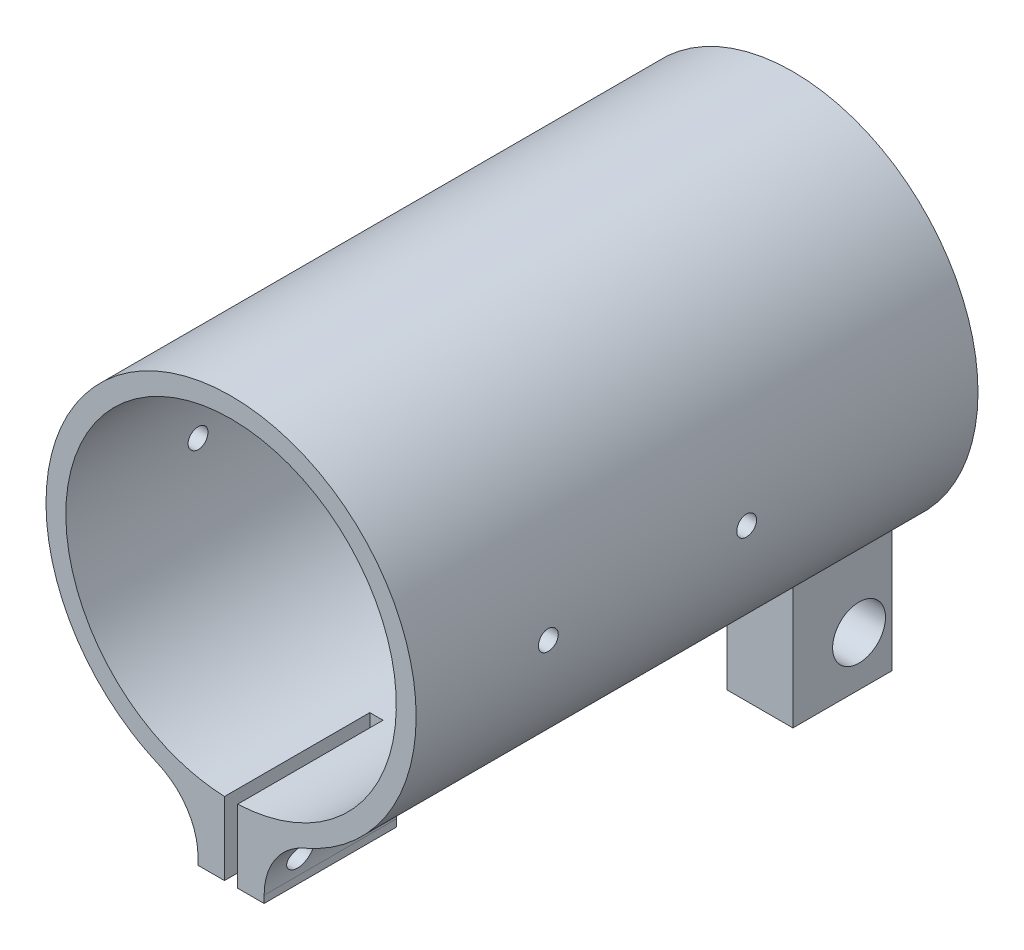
ISO-10303-21;
HEADER;
FILE_DESCRIPTION(('STEP AP214'),'2;1');
FILE_NAME('part.step','',(''),(''),'','','');
FILE_SCHEMA(('AUTOMOTIVE_DESIGN { 1 0 10303 214 1 1 1 1 }'));
ENDSEC;
DATA;
#1=APPLICATION_CONTEXT('core data for automotive mechanical design processes');
#2=APPLICATION_PROTOCOL_DEFINITION('international standard','automotive_design',2000,#1);
#3=PRODUCT_CONTEXT('',#1,'mechanical');
#4=PRODUCT('Part','Part','',(#3));
#5=PRODUCT_RELATED_PRODUCT_CATEGORY('part','',(#4));
#6=PRODUCT_DEFINITION_FORMATION('','',#4);
#7=PRODUCT_DEFINITION_CONTEXT('part definition',#1,'design');
#8=PRODUCT_DEFINITION('design','',#6,#7);
#9=PRODUCT_DEFINITION_SHAPE('','',#8);
#10=(LENGTH_UNIT() NAMED_UNIT(*) SI_UNIT(.MILLI.,.METRE.));
#11=(NAMED_UNIT(*) PLANE_ANGLE_UNIT() SI_UNIT($,.RADIAN.));
#12=(NAMED_UNIT(*) SI_UNIT($,.STERADIAN.) SOLID_ANGLE_UNIT());
#13=UNCERTAINTY_MEASURE_WITH_UNIT(LENGTH_MEASURE(1.E-05),#10,'distance_accuracy_value','');
#14=(GEOMETRIC_REPRESENTATION_CONTEXT(3) GLOBAL_UNCERTAINTY_ASSIGNED_CONTEXT((#13)) GLOBAL_UNIT_ASSIGNED_CONTEXT((#10,
#11,#12)) REPRESENTATION_CONTEXT('',''));
#15=CARTESIAN_POINT('',(0.,0.,0.));
#16=DIRECTION('',(0.,0.,1.));
#17=DIRECTION('',(1.,0.,0.));
#18=AXIS2_PLACEMENT_3D('',#15,#16,#17);
#19=CARTESIAN_POINT('',(15.,0.,5.));
#20=DIRECTION('',(0.,0.,-1.));
#21=DIRECTION('',(0.,1.,0.));
#22=AXIS2_PLACEMENT_3D('',#19,#20,#21);
#23=PLANE('',#22);
#24=DIRECTION('',(0.,-1.,0.));
#25=VECTOR('',#24,1.);
#26=CARTESIAN_POINT('',(-5.,0.,5.));
#27=LINE('',#26,#25);
#28=CARTESIAN_POINT('',(-5.,-28.,5.));
#29=VERTEX_POINT('',#28);
#30=CARTESIAN_POINT('',(-5.,-43.,5.));
#31=VERTEX_POINT('',#30);
#32=EDGE_CURVE('E238',#29,#31,#27,.T.);
#33=ORIENTED_EDGE('',*,*,#32,.F.);
#34=DIRECTION('',(1.,0.,0.));
#35=VECTOR('',#34,1.);
#36=CARTESIAN_POINT('',(-5.,-28.,5.));
#37=LINE('',#36,#35);
#38=CARTESIAN_POINT('',(0.,-28.,5.));
#39=VERTEX_POINT('',#38);
#40=EDGE_CURVE('E259',#29,#39,#37,.T.);
#41=ORIENTED_EDGE('',*,*,#40,.T.);
#42=CARTESIAN_POINT('',(0.,0.,4.99999999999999));
#43=DIRECTION('',(0.,0.,-1.));
#44=DIRECTION('',(0.,1.,0.));
#45=AXIS2_PLACEMENT_3D('',#42,#43,#44);
#46=CIRCLE('',#45,28.);
#47=CARTESIAN_POINT('',(-15.,-23.6431808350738,5.));
#48=VERTEX_POINT('',#47);
#49=EDGE_CURVE('E305',#39,#48,#46,.T.);
#50=ORIENTED_EDGE('',*,*,#49,.T.);
#51=DIRECTION('',(0.,-1.,0.));
#52=VECTOR('',#51,1.);
#53=CARTESIAN_POINT('',(-15.,0.,5.));
#54=LINE('',#53,#52);
#55=CARTESIAN_POINT('',(-15.,-43.,5.));
#56=VERTEX_POINT('',#55);
#57=EDGE_CURVE('E287',#48,#56,#54,.T.);
#58=ORIENTED_EDGE('',*,*,#57,.T.);
#59=DIRECTION('',(-1.,0.,0.));
#60=VECTOR('',#59,1.);
#61=CARTESIAN_POINT('',(15.,-43.,5.));
#62=LINE('',#61,#60);
#63=EDGE_CURVE('E298',#31,#56,#62,.T.);
#64=ORIENTED_EDGE('',*,*,#63,.F.);
#65=EDGE_LOOP('',(#33,#41,#50,#58,#64));
#66=FACE_BOUND('',#65,.T.);
#67=ADVANCED_FACE('F43',(#66),#23,.F.);
#68=CARTESIAN_POINT('',(5.,-28.,5.));
#69=VERTEX_POINT('',#68);
#70=EDGE_CURVE('E244',#39,#69,#37,.T.);
#71=ORIENTED_EDGE('',*,*,#70,.T.);
#72=DIRECTION('',(0.,-1.,0.));
#73=VECTOR('',#72,1.);
#74=CARTESIAN_POINT('',(5.,0.,5.));
#75=LINE('',#74,#73);
#76=CARTESIAN_POINT('',(5.,-43.,5.));
#77=VERTEX_POINT('',#76);
#78=EDGE_CURVE('E253',#69,#77,#75,.T.);
#79=ORIENTED_EDGE('',*,*,#78,.T.);
#80=CARTESIAN_POINT('',(15.,-43.,5.));
#81=VERTEX_POINT('',#80);
#82=EDGE_CURVE('E299',#81,#77,#62,.T.);
#83=ORIENTED_EDGE('',*,*,#82,.F.);
#84=DIRECTION('',(0.,-1.,0.));
#85=VECTOR('',#84,1.);
#86=CARTESIAN_POINT('',(15.,0.,5.));
#87=LINE('',#86,#85);
#88=CARTESIAN_POINT('',(15.,-23.6431808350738,4.99999999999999));
#89=VERTEX_POINT('',#88);
#90=EDGE_CURVE('E273',#89,#81,#87,.T.);
#91=ORIENTED_EDGE('',*,*,#90,.F.);
#92=EDGE_CURVE('E68',#89,#39,#46,.T.);
#93=ORIENTED_EDGE('',*,*,#92,.T.);
#94=EDGE_LOOP('',(#71,#79,#83,#91,#93));
#95=FACE_BOUND('',#94,.T.);
#96=ADVANCED_FACE('F484',(#95),#23,.F.);
#97=CARTESIAN_POINT('',(15.,-35.5,-5.));
#98=DIRECTION('',(-1.,0.,0.));
#99=DIRECTION('',(0.,0.,1.));
#100=AXIS2_PLACEMENT_3D('',#97,#98,#99);
#101=CYLINDRICAL_SURFACE('',#100,4.);
#102=CARTESIAN_POINT('',(-15.,-35.5,-5.));
#103=DIRECTION('',(1.,0.,0.));
#104=DIRECTION('',(0.,0.,-1.));
#105=AXIS2_PLACEMENT_3D('',#102,#103,#104);
#106=CIRCLE('',#105,4.);
#107=CARTESIAN_POINT('',(-15.,-35.5,-9.00000000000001));
#108=VERTEX_POINT('',#107);
#109=EDGE_CURVE('E263',#108,#108,#106,.T.);
#110=ORIENTED_EDGE('',*,*,#109,.F.);
#111=EDGE_LOOP('',(#110));
#112=FACE_BOUND('',#111,.T.);
#113=CARTESIAN_POINT('',(-5.,-35.5,-5.));
#114=DIRECTION('',(1.,0.,0.));
#115=DIRECTION('',(0.,0.,-1.));
#116=AXIS2_PLACEMENT_3D('',#113,#114,#115);
#117=CIRCLE('',#116,4.);
#118=CARTESIAN_POINT('',(-5.,-35.5,-9.00000000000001));
#119=VERTEX_POINT('',#118);
#120=EDGE_CURVE('E226',#119,#119,#117,.T.);
#121=ORIENTED_EDGE('',*,*,#120,.T.);
#122=EDGE_LOOP('',(#121));
#123=FACE_BOUND('',#122,.T.);
#124=ADVANCED_FACE('F490',(#112,#123),#101,.F.);
#125=CARTESIAN_POINT('',(15.,-43.,0.));
#126=DIRECTION('',(0.,1.,0.));
#127=DIRECTION('',(0.,0.,1.));
#128=AXIS2_PLACEMENT_3D('',#125,#126,#127);
#129=PLANE('',#128);
#130=DIRECTION('',(0.,0.,-1.));
#131=VECTOR('',#130,1.);
#132=CARTESIAN_POINT('',(-5.,-43.,0.));
#133=LINE('',#132,#131);
#134=CARTESIAN_POINT('',(-5.,-43.,-10.));
#135=VERTEX_POINT('',#134);
#136=EDGE_CURVE('E241',#31,#135,#133,.T.);
#137=ORIENTED_EDGE('',*,*,#136,.F.);
#138=ORIENTED_EDGE('',*,*,#63,.T.);
#139=DIRECTION('',(0.,0.,-1.));
#140=VECTOR('',#139,1.);
#141=CARTESIAN_POINT('',(-15.,-43.,0.));
#142=LINE('',#141,#140);
#143=CARTESIAN_POINT('',(-15.,-43.,-10.));
#144=VERTEX_POINT('',#143);
#145=EDGE_CURVE('E269',#56,#144,#142,.T.);
#146=ORIENTED_EDGE('',*,*,#145,.T.);
#147=DIRECTION('',(-1.,0.,0.));
#148=VECTOR('',#147,1.);
#149=CARTESIAN_POINT('',(15.,-43.,-10.));
#150=LINE('',#149,#148);
#151=EDGE_CURVE('E279',#135,#144,#150,.T.);
#152=ORIENTED_EDGE('',*,*,#151,.F.);
#153=EDGE_LOOP('',(#137,#138,#146,#152));
#154=FACE_BOUND('',#153,.T.);
#155=ADVANCED_FACE('F763',(#154),#129,.F.);
#156=CARTESIAN_POINT('',(0.,-36.,55.));
#157=DIRECTION('',(0.,-1.,0.));
#158=DIRECTION('',(0.,0.,-1.));
#159=AXIS2_PLACEMENT_3D('',#156,#157,#158);
#160=PLANE('',#159);
#161=DIRECTION('',(0.,0.,1.));
#162=VECTOR('',#161,1.);
#163=CARTESIAN_POINT('',(1.00000000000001,-36.,55.));
#164=LINE('',#163,#162);
#165=CARTESIAN_POINT('',(1.00000000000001,-36.,55.));
#166=VERTEX_POINT('',#165);
#167=CARTESIAN_POINT('',(1.00000000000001,-36.,75.));
#168=VERTEX_POINT('',#167);
#169=EDGE_CURVE('E604',#166,#168,#164,.T.);
#170=ORIENTED_EDGE('',*,*,#169,.F.);
#171=DIRECTION('',(1.,0.,0.));
#172=VECTOR('',#171,1.);
#173=CARTESIAN_POINT('',(0.,-36.,55.));
#174=LINE('',#173,#172);
#175=CARTESIAN_POINT('',(5.,-36.,55.));
#176=VERTEX_POINT('',#175);
#177=EDGE_CURVE('E568',#166,#176,#174,.T.);
#178=ORIENTED_EDGE('',*,*,#177,.T.);
#179=DIRECTION('',(0.,0.,1.));
#180=VECTOR('',#179,1.);
#181=CARTESIAN_POINT('',(5.,-36.,55.));
#182=LINE('',#181,#180);
#183=CARTESIAN_POINT('',(5.,-36.,75.));
#184=VERTEX_POINT('',#183);
#185=EDGE_CURVE('E557',#176,#184,#182,.T.);
#186=ORIENTED_EDGE('',*,*,#185,.T.);
#187=DIRECTION('',(1.,0.,0.));
#188=VECTOR('',#187,1.);
#189=CARTESIAN_POINT('',(0.,-36.,75.));
#190=LINE('',#189,#188);
#191=EDGE_CURVE('E577',#168,#184,#190,.T.);
#192=ORIENTED_EDGE('',*,*,#191,.F.);
#193=EDGE_LOOP('',(#170,#178,#186,#192));
#194=FACE_BOUND('',#193,.T.);
#195=ADVANCED_FACE('F460',(#194),#160,.T.);
#196=CARTESIAN_POINT('',(0.,0.,55.));
#197=DIRECTION('',(0.,0.,1.));
#198=DIRECTION('',(1.,0.,0.));
#199=AXIS2_PLACEMENT_3D('',#196,#197,#198);
#200=PLANE('',#199);
#201=ORIENTED_EDGE('',*,*,#177,.F.);
#202=DIRECTION('',(0.,1.,0.));
#203=VECTOR('',#202,1.);
#204=CARTESIAN_POINT('',(0.999999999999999,0.,55.));
#205=LINE('',#204,#203);
#206=CARTESIAN_POINT('',(1.00000000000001,-27.9821371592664,55.));
#207=VERTEX_POINT('',#206);
#208=EDGE_CURVE('E508',#166,#207,#205,.T.);
#209=ORIENTED_EDGE('',*,*,#208,.T.);
#210=CARTESIAN_POINT('',(0.,0.,55.));
#211=DIRECTION('',(0.,0.,1.));
#212=DIRECTION('',(1.,0.,0.));
#213=AXIS2_PLACEMENT_3D('',#210,#211,#212);
#214=CIRCLE('',#213,28.);
#215=CARTESIAN_POINT('',(11.0526315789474,-25.7262382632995,55.));
#216=VERTEX_POINT('',#215);
#217=EDGE_CURVE('E585',#207,#216,#214,.T.);
#218=ORIENTED_EDGE('',*,*,#217,.T.);
#219=CARTESIAN_POINT('',(15.,-34.9141805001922,55.));
#220=DIRECTION('',(0.,0.,1.));
#221=DIRECTION('',(1.,0.,0.));
#222=AXIS2_PLACEMENT_3D('',#219,#220,#221);
#223=CIRCLE('',#222,10.);
#224=CARTESIAN_POINT('',(5.,-34.9141805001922,55.));
#225=VERTEX_POINT('',#224);
#226=EDGE_CURVE('E520',#216,#225,#223,.T.);
#227=ORIENTED_EDGE('',*,*,#226,.T.);
#228=DIRECTION('',(0.,1.,0.));
#229=VECTOR('',#228,1.);
#230=CARTESIAN_POINT('',(5.,0.,55.));
#231=LINE('',#230,#229);
#232=EDGE_CURVE('E586',#176,#225,#231,.T.);
#233=ORIENTED_EDGE('',*,*,#232,.F.);
#234=EDGE_LOOP('',(#201,#209,#218,#227,#233));
#235=FACE_BOUND('',#234,.T.);
#236=ADVANCED_FACE('F396',(#235),#200,.F.);
#237=CARTESIAN_POINT('',(0.,0.,75.));
#238=DIRECTION('',(0.,0.,-1.));
#239=DIRECTION('',(-1.,0.,0.));
#240=AXIS2_PLACEMENT_3D('',#237,#238,#239);
#241=CYLINDRICAL_SURFACE('',#240,28.);
#242=CARTESIAN_POINT('',(-28.,0.,53.5));
#243=CARTESIAN_POINT('',(-27.9999994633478,0.0841908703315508,53.5000037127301));
#244=CARTESIAN_POINT('',(-27.9996162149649,0.168441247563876,53.5071119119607));
#245=CARTESIAN_POINT('',(-27.9981242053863,0.334617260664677,53.535366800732));
#246=CARTESIAN_POINT('',(-27.9970145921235,0.416540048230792,53.556529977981));
#247=CARTESIAN_POINT('',(-27.9941954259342,0.57562965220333,53.6122866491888));
#248=CARTESIAN_POINT('',(-27.9924861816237,0.652798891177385,53.6468732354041));
#249=CARTESIAN_POINT('',(-27.9886601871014,0.800215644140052,53.7284841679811));
#250=CARTESIAN_POINT('',(-27.9865435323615,0.870464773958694,53.7755056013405));
#251=CARTESIAN_POINT('',(-27.9821380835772,1.00214789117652,53.8807107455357));
#252=CARTESIAN_POINT('',(-27.9798491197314,1.06357300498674,53.9389055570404));
#253=CARTESIAN_POINT('',(-27.9753584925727,1.1757887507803,54.0647831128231));
#254=CARTESIAN_POINT('',(-27.9731568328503,1.22657894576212,54.1324662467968));
#255=CARTESIAN_POINT('',(-27.9690878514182,1.31610854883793,54.2754469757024));
#256=CARTESIAN_POINT('',(-27.9672207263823,1.35484087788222,54.3507490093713));
#257=CARTESIAN_POINT('',(-27.9640334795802,1.41910990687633,54.5067987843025));
#258=CARTESIAN_POINT('',(-27.9627133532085,1.44464671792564,54.5875464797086));
#259=CARTESIAN_POINT('',(-27.9607705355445,1.4817759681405,54.7521124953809));
#260=CARTESIAN_POINT('',(-27.9601471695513,1.49338189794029,54.8359277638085));
#261=CARTESIAN_POINT('',(-27.9596661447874,1.50236156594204,55.0043189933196));
#262=CARTESIAN_POINT('',(-27.9598084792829,1.49973542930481,55.088894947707));
#263=CARTESIAN_POINT('',(-27.9608421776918,1.48033673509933,55.2563149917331));
#264=CARTESIAN_POINT('',(-27.9617327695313,1.46357875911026,55.3391607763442));
#265=CARTESIAN_POINT('',(-27.9641613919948,1.41641468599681,55.5008616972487));
#266=CARTESIAN_POINT('',(-27.9656994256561,1.38600852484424,55.5797168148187));
#267=CARTESIAN_POINT('',(-27.9692504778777,1.31239457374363,55.731244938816));
#268=CARTESIAN_POINT('',(-27.9712637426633,1.26918014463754,55.803914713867));
#269=CARTESIAN_POINT('',(-27.9755381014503,1.1711811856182,55.9409739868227));
#270=CARTESIAN_POINT('',(-27.9777991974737,1.11639656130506,56.0053634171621));
#271=CARTESIAN_POINT('',(-27.9823178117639,0.996730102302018,56.1241190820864));
#272=CARTESIAN_POINT('',(-27.9845753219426,0.931835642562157,56.1784725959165));
#273=CARTESIAN_POINT('',(-27.9888295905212,0.793835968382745,56.2755154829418));
#274=CARTESIAN_POINT('',(-27.9908263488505,0.720730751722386,56.3182048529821));
#275=CARTESIAN_POINT('',(-27.9943341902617,0.568377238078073,56.3907064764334));
#276=CARTESIAN_POINT('',(-27.995845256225,0.489128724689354,56.4205182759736));
#277=CARTESIAN_POINT('',(-27.9982111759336,0.326741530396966,56.466410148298));
#278=CARTESIAN_POINT('',(-27.9990660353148,0.243602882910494,56.4824903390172));
#279=CARTESIAN_POINT('',(-28.0000224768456,0.0759058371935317,56.500446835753));
#280=CARTESIAN_POINT('',(-28.0001249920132,-0.00865067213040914,56.5023407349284));
#281=CARTESIAN_POINT('',(-27.9995676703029,-0.17688025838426,56.4919168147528));
#282=CARTESIAN_POINT('',(-27.9989078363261,-0.260553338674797,56.4795990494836));
#283=CARTESIAN_POINT('',(-27.9969007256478,-0.424591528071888,56.4411160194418));
#284=CARTESIAN_POINT('',(-27.9955538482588,-0.504958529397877,56.4149587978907));
#285=CARTESIAN_POINT('',(-27.9923242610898,-0.660161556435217,56.3495475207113));
#286=CARTESIAN_POINT('',(-27.9904415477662,-0.734997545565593,56.3102933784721));
#287=CARTESIAN_POINT('',(-27.9863496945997,-0.87709495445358,56.2197575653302));
#288=CARTESIAN_POINT('',(-27.9841402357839,-0.944348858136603,56.1684641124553));
#289=CARTESIAN_POINT('',(-27.9796447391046,-1.06929740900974,56.0553229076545));
#290=CARTESIAN_POINT('',(-27.9773587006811,-1.12699198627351,55.9934750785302));
#291=CARTESIAN_POINT('',(-27.9729650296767,-1.23124347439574,55.8609050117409));
#292=CARTESIAN_POINT('',(-27.9708575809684,-1.27778899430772,55.7901738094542));
#293=CARTESIAN_POINT('',(-27.967061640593,-1.35834324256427,55.6418900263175));
#294=CARTESIAN_POINT('',(-27.9653731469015,-1.39235203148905,55.5643374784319));
#295=CARTESIAN_POINT('',(-27.9626068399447,-1.44684760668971,55.404654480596));
#296=CARTESIAN_POINT('',(-27.9615286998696,-1.4673416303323,55.322526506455));
#297=CARTESIAN_POINT('',(-27.9601037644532,-1.4942495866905,55.1559893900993));
#298=CARTESIAN_POINT('',(-27.9597569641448,-1.50066361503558,55.0715802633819));
#299=CARTESIAN_POINT('',(-27.9598339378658,-1.4992286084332,54.9029902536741));
#300=CARTESIAN_POINT('',(-27.960256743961,-1.4913974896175,54.8188092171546));
#301=CARTESIAN_POINT('',(-27.9618232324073,-1.46173155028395,54.6529589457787));
#302=CARTESIAN_POINT('',(-27.9629669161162,-1.43989670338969,54.5712897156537));
#303=CARTESIAN_POINT('',(-27.9658460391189,-1.38284689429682,54.412777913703));
#304=CARTESIAN_POINT('',(-27.9675814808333,-1.34763187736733,54.3359353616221));
#305=CARTESIAN_POINT('',(-27.9714484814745,-1.26482422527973,54.1892517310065));
#306=CARTESIAN_POINT('',(-27.9735800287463,-1.21723195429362,54.1194104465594));
#307=CARTESIAN_POINT('',(-27.9780020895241,-1.11095584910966,53.9886219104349));
#308=CARTESIAN_POINT('',(-27.9802927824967,-1.05225936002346,53.9276849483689));
#309=CARTESIAN_POINT('',(-27.9847736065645,-0.925452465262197,53.816510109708));
#310=CARTESIAN_POINT('',(-27.9869637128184,-0.857339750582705,53.766274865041));
#311=CARTESIAN_POINT('',(-27.9909982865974,-0.713574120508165,53.6779024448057));
#312=CARTESIAN_POINT('',(-27.9928423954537,-0.63791350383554,53.6397777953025));
#313=CARTESIAN_POINT('',(-27.9959719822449,-0.481311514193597,53.5768186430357));
#314=CARTESIAN_POINT('',(-27.9972581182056,-0.400376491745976,53.5519684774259));
#315=CARTESIAN_POINT('',(-27.998787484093,-0.265783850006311,53.5227663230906));
#316=CARTESIAN_POINT('',(-27.9992401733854,-0.212997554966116,53.5142398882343));
#317=CARTESIAN_POINT('',(-27.9998466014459,-0.106815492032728,53.5028555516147));
#318=CARTESIAN_POINT('',(-28.0000003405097,-0.0534197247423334,53.4999976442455));
#319=CARTESIAN_POINT('',(-28.,0.,53.5));
#320=B_SPLINE_CURVE_WITH_KNOTS('',3,(#242,#243,#244,#245,#246,#247,#248,#249,#250,#251,#252,
#253,#254,#255,#256,#257,#258,#259,#260,#261,#262,#263,#264,#265,#266,#267,#268,#269,#270,#271,
#272,#273,#274,#275,#276,#277,#278,#279,#280,#281,#282,#283,#284,#285,#286,#287,#288,#289,#290,
#291,#292,#293,#294,#295,#296,#297,#298,#299,#300,#301,#302,#303,#304,#305,#306,#307,#308,#309,
#310,#311,#312,#313,#314,#315,#316,#317,#318,#319),.UNSPECIFIED.,.T.,.F.,(4,2,2,2,2,2,2,2,2,2,2,
2,2,2,2,2,2,2,2,2,2,2,2,2,2,2,2,2,2,2,2,2,2,2,2,2,2,2,4),(0.,0.252377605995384,
0.505051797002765,0.757596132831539,1.01008135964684,1.26281873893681,1.51556650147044,
1.76846237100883,2.02135611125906,2.27400475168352,2.52665117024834,2.77903722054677,
3.0314244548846,3.28394274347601,3.53646309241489,3.78930135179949,4.04213967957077,
4.29498691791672,4.54783198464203,4.8003634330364,5.05289392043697,5.30527780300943,
5.55766335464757,5.81029693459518,6.06293236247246,6.31582481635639,6.5687160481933,
6.82147174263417,7.07422572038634,7.32666202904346,7.57909881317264,7.8315366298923,
8.08396702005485,8.33668684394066,8.58946874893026,8.84251126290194,9.09525454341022,
9.25539014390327,9.41552558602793),.UNSPECIFIED.);
#321=CARTESIAN_POINT('',(-28.,0.,53.5));
#322=VERTEX_POINT('',#321);
#323=EDGE_CURVE('E381',#322,#322,#320,.T.);
#324=ORIENTED_EDGE('',*,*,#323,.T.);
#325=EDGE_LOOP('',(#324));
#326=FACE_BOUND('',#325,.T.);
#327=CARTESIAN_POINT('',(28.,0.,53.5));
#328=CARTESIAN_POINT('',(27.9999994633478,-0.0841908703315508,53.5000037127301));
#329=CARTESIAN_POINT('',(27.9996162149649,-0.168441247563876,53.5071119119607));
#330=CARTESIAN_POINT('',(27.9981242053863,-0.334617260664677,53.535366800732));
#331=CARTESIAN_POINT('',(27.9970145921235,-0.416540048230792,53.556529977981));
#332=CARTESIAN_POINT('',(27.9941954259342,-0.57562965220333,53.6122866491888));
#333=CARTESIAN_POINT('',(27.9924861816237,-0.652798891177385,53.6468732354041));
#334=CARTESIAN_POINT('',(27.9886601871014,-0.800215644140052,53.7284841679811));
#335=CARTESIAN_POINT('',(27.9865435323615,-0.870464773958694,53.7755056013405));
#336=CARTESIAN_POINT('',(27.9821380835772,-1.00214789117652,53.8807107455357));
#337=CARTESIAN_POINT('',(27.9798491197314,-1.06357300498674,53.9389055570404));
#338=CARTESIAN_POINT('',(27.9753584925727,-1.1757887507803,54.0647831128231));
#339=CARTESIAN_POINT('',(27.9731568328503,-1.22657894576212,54.1324662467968));
#340=CARTESIAN_POINT('',(27.9690878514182,-1.31610854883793,54.2754469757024));
#341=CARTESIAN_POINT('',(27.9672207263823,-1.35484087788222,54.3507490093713));
#342=CARTESIAN_POINT('',(27.9640334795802,-1.41910990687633,54.5067987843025));
#343=CARTESIAN_POINT('',(27.9627133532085,-1.44464671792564,54.5875464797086));
#344=CARTESIAN_POINT('',(27.9607705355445,-1.4817759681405,54.7521124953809));
#345=CARTESIAN_POINT('',(27.9601471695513,-1.49338189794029,54.8359277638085));
#346=CARTESIAN_POINT('',(27.9596661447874,-1.50236156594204,55.0043189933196));
#347=CARTESIAN_POINT('',(27.9598084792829,-1.49973542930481,55.088894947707));
#348=CARTESIAN_POINT('',(27.9608421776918,-1.48033673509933,55.2563149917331));
#349=CARTESIAN_POINT('',(27.9617327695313,-1.46357875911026,55.3391607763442));
#350=CARTESIAN_POINT('',(27.9641613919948,-1.41641468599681,55.5008616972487));
#351=CARTESIAN_POINT('',(27.9656994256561,-1.38600852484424,55.5797168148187));
#352=CARTESIAN_POINT('',(27.9692504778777,-1.31239457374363,55.731244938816));
#353=CARTESIAN_POINT('',(27.9712637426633,-1.26918014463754,55.803914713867));
#354=CARTESIAN_POINT('',(27.9755381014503,-1.1711811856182,55.9409739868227));
#355=CARTESIAN_POINT('',(27.9777991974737,-1.11639656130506,56.0053634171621));
#356=CARTESIAN_POINT('',(27.9823178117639,-0.996730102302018,56.1241190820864));
#357=CARTESIAN_POINT('',(27.9845753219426,-0.931835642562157,56.1784725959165));
#358=CARTESIAN_POINT('',(27.9888295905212,-0.793835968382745,56.2755154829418));
#359=CARTESIAN_POINT('',(27.9908263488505,-0.720730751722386,56.3182048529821));
#360=CARTESIAN_POINT('',(27.9943341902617,-0.568377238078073,56.3907064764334));
#361=CARTESIAN_POINT('',(27.995845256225,-0.489128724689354,56.4205182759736));
#362=CARTESIAN_POINT('',(27.9982111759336,-0.326741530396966,56.466410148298));
#363=CARTESIAN_POINT('',(27.9990660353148,-0.243602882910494,56.4824903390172));
#364=CARTESIAN_POINT('',(28.0000224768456,-0.0759058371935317,56.500446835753));
#365=CARTESIAN_POINT('',(28.0001249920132,0.00865067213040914,56.5023407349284));
#366=CARTESIAN_POINT('',(27.9995676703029,0.17688025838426,56.4919168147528));
#367=CARTESIAN_POINT('',(27.9989078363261,0.260553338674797,56.4795990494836));
#368=CARTESIAN_POINT('',(27.9969007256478,0.424591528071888,56.4411160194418));
#369=CARTESIAN_POINT('',(27.9955538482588,0.504958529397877,56.4149587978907));
#370=CARTESIAN_POINT('',(27.9923242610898,0.660161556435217,56.3495475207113));
#371=CARTESIAN_POINT('',(27.9904415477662,0.734997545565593,56.3102933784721));
#372=CARTESIAN_POINT('',(27.9863496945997,0.87709495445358,56.2197575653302));
#373=CARTESIAN_POINT('',(27.9841402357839,0.944348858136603,56.1684641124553));
#374=CARTESIAN_POINT('',(27.9796447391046,1.06929740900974,56.0553229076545));
#375=CARTESIAN_POINT('',(27.9773587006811,1.12699198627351,55.9934750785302));
#376=CARTESIAN_POINT('',(27.9729650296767,1.23124347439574,55.8609050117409));
#377=CARTESIAN_POINT('',(27.9708575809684,1.27778899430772,55.7901738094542));
#378=CARTESIAN_POINT('',(27.967061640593,1.35834324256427,55.6418900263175));
#379=CARTESIAN_POINT('',(27.9653731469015,1.39235203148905,55.5643374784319));
#380=CARTESIAN_POINT('',(27.9626068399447,1.44684760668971,55.404654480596));
#381=CARTESIAN_POINT('',(27.9615286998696,1.4673416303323,55.322526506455));
#382=CARTESIAN_POINT('',(27.9601037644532,1.4942495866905,55.1559893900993));
#383=CARTESIAN_POINT('',(27.9597569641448,1.50066361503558,55.0715802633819));
#384=CARTESIAN_POINT('',(27.9598339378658,1.4992286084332,54.9029902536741));
#385=CARTESIAN_POINT('',(27.960256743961,1.4913974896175,54.8188092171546));
#386=CARTESIAN_POINT('',(27.9618232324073,1.46173155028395,54.6529589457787));
#387=CARTESIAN_POINT('',(27.9629669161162,1.43989670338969,54.5712897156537));
#388=CARTESIAN_POINT('',(27.9658460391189,1.38284689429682,54.412777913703));
#389=CARTESIAN_POINT('',(27.9675814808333,1.34763187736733,54.3359353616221));
#390=CARTESIAN_POINT('',(27.9714484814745,1.26482422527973,54.1892517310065));
#391=CARTESIAN_POINT('',(27.9735800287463,1.21723195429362,54.1194104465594));
#392=CARTESIAN_POINT('',(27.9780020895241,1.11095584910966,53.9886219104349));
#393=CARTESIAN_POINT('',(27.9802927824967,1.05225936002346,53.9276849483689));
#394=CARTESIAN_POINT('',(27.9847736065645,0.925452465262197,53.816510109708));
#395=CARTESIAN_POINT('',(27.9869637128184,0.857339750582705,53.766274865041));
#396=CARTESIAN_POINT('',(27.9909982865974,0.713574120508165,53.6779024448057));
#397=CARTESIAN_POINT('',(27.9928423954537,0.63791350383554,53.6397777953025));
#398=CARTESIAN_POINT('',(27.9959719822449,0.481311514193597,53.5768186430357));
#399=CARTESIAN_POINT('',(27.9972581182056,0.400376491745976,53.5519684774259));
#400=CARTESIAN_POINT('',(27.998787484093,0.265783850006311,53.5227663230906));
#401=CARTESIAN_POINT('',(27.9992401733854,0.212997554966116,53.5142398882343));
#402=CARTESIAN_POINT('',(27.9998466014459,0.106815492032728,53.5028555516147));
#403=CARTESIAN_POINT('',(28.0000003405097,0.0534197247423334,53.4999976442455));
#404=CARTESIAN_POINT('',(28.,0.,53.5));
#405=B_SPLINE_CURVE_WITH_KNOTS('',3,(#327,#328,#329,#330,#331,#332,#333,#334,#335,#336,#337,
#338,#339,#340,#341,#342,#343,#344,#345,#346,#347,#348,#349,#350,#351,#352,#353,#354,#355,#356,
#357,#358,#359,#360,#361,#362,#363,#364,#365,#366,#367,#368,#369,#370,#371,#372,#373,#374,#375,
#376,#377,#378,#379,#380,#381,#382,#383,#384,#385,#386,#387,#388,#389,#390,#391,#392,#393,#394,
#395,#396,#397,#398,#399,#400,#401,#402,#403,#404),.UNSPECIFIED.,.T.,.F.,(4,2,2,2,2,2,2,2,2,2,2,
2,2,2,2,2,2,2,2,2,2,2,2,2,2,2,2,2,2,2,2,2,2,2,2,2,2,2,4),(0.,0.252377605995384,
0.505051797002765,0.757596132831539,1.01008135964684,1.26281873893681,1.51556650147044,
1.76846237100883,2.02135611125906,2.27400475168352,2.52665117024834,2.77903722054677,
3.0314244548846,3.28394274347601,3.53646309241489,3.78930135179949,4.04213967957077,
4.29498691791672,4.54783198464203,4.8003634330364,5.05289392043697,5.30527780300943,
5.55766335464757,5.81029693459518,6.06293236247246,6.31582481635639,6.5687160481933,
6.82147174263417,7.07422572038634,7.32666202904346,7.57909881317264,7.8315366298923,
8.08396702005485,8.33668684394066,8.58946874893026,8.84251126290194,9.09525454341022,
9.25539014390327,9.41552558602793),.UNSPECIFIED.);
#406=CARTESIAN_POINT('',(28.,0.,53.5));
#407=VERTEX_POINT('',#406);
#408=EDGE_CURVE('E373',#407,#407,#405,.T.);
#409=ORIENTED_EDGE('',*,*,#408,.T.);
#410=EDGE_LOOP('',(#409));
#411=FACE_BOUND('',#410,.T.);
#412=CARTESIAN_POINT('',(-28.,0.,23.5));
#413=CARTESIAN_POINT('',(-27.9999994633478,0.0841908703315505,23.5000037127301));
#414=CARTESIAN_POINT('',(-27.9996162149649,0.168441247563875,23.5071119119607));
#415=CARTESIAN_POINT('',(-27.9981242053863,0.334617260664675,23.535366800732));
#416=CARTESIAN_POINT('',(-27.9970145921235,0.41654004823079,23.556529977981));
#417=CARTESIAN_POINT('',(-27.9941954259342,0.575629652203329,23.6122866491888));
#418=CARTESIAN_POINT('',(-27.9924861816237,0.652798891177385,23.6468732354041));
#419=CARTESIAN_POINT('',(-27.9886601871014,0.800215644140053,23.7284841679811));
#420=CARTESIAN_POINT('',(-27.9865435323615,0.870464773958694,23.7755056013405));
#421=CARTESIAN_POINT('',(-27.9821380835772,1.00214789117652,23.8807107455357));
#422=CARTESIAN_POINT('',(-27.9798491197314,1.06357300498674,23.9389055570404));
#423=CARTESIAN_POINT('',(-27.9753584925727,1.1757887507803,24.0647831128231));
#424=CARTESIAN_POINT('',(-27.9731568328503,1.22657894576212,24.1324662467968));
#425=CARTESIAN_POINT('',(-27.9690878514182,1.31610854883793,24.2754469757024));
#426=CARTESIAN_POINT('',(-27.9672207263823,1.35484087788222,24.3507490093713));
#427=CARTESIAN_POINT('',(-27.9640334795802,1.41910990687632,24.5067987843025));
#428=CARTESIAN_POINT('',(-27.9627133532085,1.44464671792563,24.5875464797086));
#429=CARTESIAN_POINT('',(-27.9607705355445,1.4817759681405,24.7521124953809));
#430=CARTESIAN_POINT('',(-27.9601471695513,1.49338189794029,24.8359277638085));
#431=CARTESIAN_POINT('',(-27.9596661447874,1.50236156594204,25.0043189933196));
#432=CARTESIAN_POINT('',(-27.9598084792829,1.49973542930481,25.088894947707));
#433=CARTESIAN_POINT('',(-27.9608421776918,1.48033673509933,25.2563149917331));
#434=CARTESIAN_POINT('',(-27.9617327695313,1.46357875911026,25.3391607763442));
#435=CARTESIAN_POINT('',(-27.9641613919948,1.4164146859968,25.5008616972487));
#436=CARTESIAN_POINT('',(-27.9656994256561,1.38600852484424,25.5797168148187));
#437=CARTESIAN_POINT('',(-27.9692504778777,1.31239457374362,25.731244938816));
#438=CARTESIAN_POINT('',(-27.9712637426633,1.26918014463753,25.803914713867));
#439=CARTESIAN_POINT('',(-27.9755381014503,1.1711811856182,25.9409739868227));
#440=CARTESIAN_POINT('',(-27.9777991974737,1.11639656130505,26.0053634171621));
#441=CARTESIAN_POINT('',(-27.9823178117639,0.99673010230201,26.1241190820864));
#442=CARTESIAN_POINT('',(-27.9845753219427,0.931835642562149,26.1784725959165));
#443=CARTESIAN_POINT('',(-27.9888295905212,0.793835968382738,26.2755154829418));
#444=CARTESIAN_POINT('',(-27.9908263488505,0.720730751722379,26.3182048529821));
#445=CARTESIAN_POINT('',(-27.9943341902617,0.568377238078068,26.3907064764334));
#446=CARTESIAN_POINT('',(-27.995845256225,0.489128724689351,26.4205182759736));
#447=CARTESIAN_POINT('',(-27.9982111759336,0.326741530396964,26.466410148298));
#448=CARTESIAN_POINT('',(-27.9990660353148,0.243602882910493,26.4824903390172));
#449=CARTESIAN_POINT('',(-28.0000224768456,0.0759058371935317,26.500446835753));
#450=CARTESIAN_POINT('',(-28.0001249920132,-0.00865067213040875,26.5023407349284));
#451=CARTESIAN_POINT('',(-27.9995676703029,-0.17688025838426,26.4919168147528));
#452=CARTESIAN_POINT('',(-27.9989078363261,-0.260553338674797,26.4795990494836));
#453=CARTESIAN_POINT('',(-27.9969007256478,-0.424591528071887,26.4411160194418));
#454=CARTESIAN_POINT('',(-27.9955538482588,-0.504958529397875,26.4149587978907));
#455=CARTESIAN_POINT('',(-27.9923242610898,-0.660161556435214,26.3495475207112));
#456=CARTESIAN_POINT('',(-27.9904415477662,-0.734997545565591,26.3102933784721));
#457=CARTESIAN_POINT('',(-27.9863496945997,-0.877094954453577,26.2197575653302));
#458=CARTESIAN_POINT('',(-27.9841402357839,-0.944348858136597,26.1684641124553));
#459=CARTESIAN_POINT('',(-27.9796447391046,-1.06929740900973,26.0553229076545));
#460=CARTESIAN_POINT('',(-27.9773587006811,-1.1269919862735,25.9934750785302));
#461=CARTESIAN_POINT('',(-27.9729650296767,-1.23124347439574,25.8609050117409));
#462=CARTESIAN_POINT('',(-27.9708575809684,-1.27778899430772,25.7901738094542));
#463=CARTESIAN_POINT('',(-27.967061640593,-1.35834324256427,25.6418900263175));
#464=CARTESIAN_POINT('',(-27.9653731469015,-1.39235203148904,25.5643374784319));
#465=CARTESIAN_POINT('',(-27.9626068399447,-1.44684760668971,25.404654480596));
#466=CARTESIAN_POINT('',(-27.9615286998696,-1.4673416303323,25.322526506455));
#467=CARTESIAN_POINT('',(-27.9601037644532,-1.4942495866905,25.1559893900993));
#468=CARTESIAN_POINT('',(-27.9597569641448,-1.50066361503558,25.0715802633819));
#469=CARTESIAN_POINT('',(-27.9598339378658,-1.4992286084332,24.9029902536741));
#470=CARTESIAN_POINT('',(-27.960256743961,-1.4913974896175,24.8188092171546));
#471=CARTESIAN_POINT('',(-27.9618232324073,-1.46173155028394,24.6529589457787));
#472=CARTESIAN_POINT('',(-27.9629669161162,-1.43989670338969,24.5712897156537));
#473=CARTESIAN_POINT('',(-27.9658460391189,-1.38284689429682,24.412777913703));
#474=CARTESIAN_POINT('',(-27.9675814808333,-1.34763187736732,24.3359353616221));
#475=CARTESIAN_POINT('',(-27.9714484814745,-1.26482422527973,24.1892517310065));
#476=CARTESIAN_POINT('',(-27.9735800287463,-1.21723195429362,24.1194104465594));
#477=CARTESIAN_POINT('',(-27.9780020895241,-1.11095584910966,23.9886219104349));
#478=CARTESIAN_POINT('',(-27.9802927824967,-1.05225936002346,23.9276849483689));
#479=CARTESIAN_POINT('',(-27.9847736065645,-0.925452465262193,23.816510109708));
#480=CARTESIAN_POINT('',(-27.9869637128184,-0.8573397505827,23.766274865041));
#481=CARTESIAN_POINT('',(-27.9909982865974,-0.713574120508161,23.6779024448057));
#482=CARTESIAN_POINT('',(-27.9928423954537,-0.637913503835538,23.6397777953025));
#483=CARTESIAN_POINT('',(-27.9959719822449,-0.481311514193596,23.5768186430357));
#484=CARTESIAN_POINT('',(-27.9972581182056,-0.400376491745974,23.5519684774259));
#485=CARTESIAN_POINT('',(-27.998787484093,-0.265783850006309,23.5227663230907));
#486=CARTESIAN_POINT('',(-27.9992401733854,-0.212997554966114,23.5142398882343));
#487=CARTESIAN_POINT('',(-27.9998466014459,-0.106815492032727,23.5028555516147));
#488=CARTESIAN_POINT('',(-28.0000003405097,-0.0534197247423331,23.4999976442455));
#489=CARTESIAN_POINT('',(-28.,0.,23.5));
#490=B_SPLINE_CURVE_WITH_KNOTS('',3,(#412,#413,#414,#415,#416,#417,#418,#419,#420,#421,#422,
#423,#424,#425,#426,#427,#428,#429,#430,#431,#432,#433,#434,#435,#436,#437,#438,#439,#440,#441,
#442,#443,#444,#445,#446,#447,#448,#449,#450,#451,#452,#453,#454,#455,#456,#457,#458,#459,#460,
#461,#462,#463,#464,#465,#466,#467,#468,#469,#470,#471,#472,#473,#474,#475,#476,#477,#478,#479,
#480,#481,#482,#483,#484,#485,#486,#487,#488,#489),.UNSPECIFIED.,.T.,.F.,(4,2,2,2,2,2,2,2,2,2,2,
2,2,2,2,2,2,2,2,2,2,2,2,2,2,2,2,2,2,2,2,2,2,2,2,2,2,2,4),(0.,0.252377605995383,
0.505051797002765,0.757596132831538,1.01008135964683,1.26281873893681,1.51556650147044,
1.76846237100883,2.02135611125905,2.27400475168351,2.52665117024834,2.77903722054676,
3.0314244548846,3.28394274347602,3.53646309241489,3.78930135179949,4.04213967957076,
4.29498691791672,4.54783198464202,4.80036343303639,5.05289392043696,5.30527780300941,
5.55766335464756,5.81029693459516,6.06293236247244,6.31582481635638,6.56871604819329,
6.82147174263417,7.07422572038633,7.32666202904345,7.57909881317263,7.83153662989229,
8.08396702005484,8.33668684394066,8.58946874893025,8.84251126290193,9.09525454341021,
9.25539014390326,9.41552558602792),.UNSPECIFIED.);
#491=CARTESIAN_POINT('',(-28.,0.,23.5));
#492=VERTEX_POINT('',#491);
#493=EDGE_CURVE('E382',#492,#492,#490,.T.);
#494=ORIENTED_EDGE('',*,*,#493,.T.);
#495=EDGE_LOOP('',(#494));
#496=FACE_BOUND('',#495,.T.);
#497=CARTESIAN_POINT('',(28.,0.,23.5));
#498=CARTESIAN_POINT('',(27.9999994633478,-0.0841908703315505,23.5000037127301));
#499=CARTESIAN_POINT('',(27.9996162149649,-0.168441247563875,23.5071119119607));
#500=CARTESIAN_POINT('',(27.9981242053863,-0.334617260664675,23.535366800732));
#501=CARTESIAN_POINT('',(27.9970145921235,-0.41654004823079,23.556529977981));
#502=CARTESIAN_POINT('',(27.9941954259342,-0.575629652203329,23.6122866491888));
#503=CARTESIAN_POINT('',(27.9924861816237,-0.652798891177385,23.6468732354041));
#504=CARTESIAN_POINT('',(27.9886601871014,-0.800215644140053,23.7284841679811));
#505=CARTESIAN_POINT('',(27.9865435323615,-0.870464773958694,23.7755056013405));
#506=CARTESIAN_POINT('',(27.9821380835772,-1.00214789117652,23.8807107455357));
#507=CARTESIAN_POINT('',(27.9798491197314,-1.06357300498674,23.9389055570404));
#508=CARTESIAN_POINT('',(27.9753584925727,-1.1757887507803,24.0647831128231));
#509=CARTESIAN_POINT('',(27.9731568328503,-1.22657894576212,24.1324662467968));
#510=CARTESIAN_POINT('',(27.9690878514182,-1.31610854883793,24.2754469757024));
#511=CARTESIAN_POINT('',(27.9672207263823,-1.35484087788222,24.3507490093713));
#512=CARTESIAN_POINT('',(27.9640334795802,-1.41910990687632,24.5067987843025));
#513=CARTESIAN_POINT('',(27.9627133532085,-1.44464671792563,24.5875464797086));
#514=CARTESIAN_POINT('',(27.9607705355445,-1.4817759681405,24.7521124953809));
#515=CARTESIAN_POINT('',(27.9601471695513,-1.49338189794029,24.8359277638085));
#516=CARTESIAN_POINT('',(27.9596661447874,-1.50236156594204,25.0043189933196));
#517=CARTESIAN_POINT('',(27.9598084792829,-1.49973542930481,25.088894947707));
#518=CARTESIAN_POINT('',(27.9608421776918,-1.48033673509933,25.2563149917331));
#519=CARTESIAN_POINT('',(27.9617327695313,-1.46357875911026,25.3391607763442));
#520=CARTESIAN_POINT('',(27.9641613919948,-1.4164146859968,25.5008616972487));
#521=CARTESIAN_POINT('',(27.9656994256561,-1.38600852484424,25.5797168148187));
#522=CARTESIAN_POINT('',(27.9692504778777,-1.31239457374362,25.731244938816));
#523=CARTESIAN_POINT('',(27.9712637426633,-1.26918014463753,25.803914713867));
#524=CARTESIAN_POINT('',(27.9755381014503,-1.1711811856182,25.9409739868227));
#525=CARTESIAN_POINT('',(27.9777991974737,-1.11639656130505,26.0053634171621));
#526=CARTESIAN_POINT('',(27.9823178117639,-0.99673010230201,26.1241190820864));
#527=CARTESIAN_POINT('',(27.9845753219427,-0.931835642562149,26.1784725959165));
#528=CARTESIAN_POINT('',(27.9888295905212,-0.793835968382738,26.2755154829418));
#529=CARTESIAN_POINT('',(27.9908263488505,-0.720730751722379,26.3182048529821));
#530=CARTESIAN_POINT('',(27.9943341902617,-0.568377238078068,26.3907064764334));
#531=CARTESIAN_POINT('',(27.995845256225,-0.489128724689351,26.4205182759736));
#532=CARTESIAN_POINT('',(27.9982111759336,-0.326741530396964,26.466410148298));
#533=CARTESIAN_POINT('',(27.9990660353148,-0.243602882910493,26.4824903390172));
#534=CARTESIAN_POINT('',(28.0000224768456,-0.0759058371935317,26.500446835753));
#535=CARTESIAN_POINT('',(28.0001249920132,0.00865067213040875,26.5023407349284));
#536=CARTESIAN_POINT('',(27.9995676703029,0.17688025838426,26.4919168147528));
#537=CARTESIAN_POINT('',(27.9989078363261,0.260553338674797,26.4795990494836));
#538=CARTESIAN_POINT('',(27.9969007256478,0.424591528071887,26.4411160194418));
#539=CARTESIAN_POINT('',(27.9955538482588,0.504958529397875,26.4149587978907));
#540=CARTESIAN_POINT('',(27.9923242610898,0.660161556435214,26.3495475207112));
#541=CARTESIAN_POINT('',(27.9904415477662,0.734997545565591,26.3102933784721));
#542=CARTESIAN_POINT('',(27.9863496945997,0.877094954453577,26.2197575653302));
#543=CARTESIAN_POINT('',(27.9841402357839,0.944348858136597,26.1684641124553));
#544=CARTESIAN_POINT('',(27.9796447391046,1.06929740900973,26.0553229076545));
#545=CARTESIAN_POINT('',(27.9773587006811,1.1269919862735,25.9934750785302));
#546=CARTESIAN_POINT('',(27.9729650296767,1.23124347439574,25.8609050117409));
#547=CARTESIAN_POINT('',(27.9708575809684,1.27778899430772,25.7901738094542));
#548=CARTESIAN_POINT('',(27.967061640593,1.35834324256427,25.6418900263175));
#549=CARTESIAN_POINT('',(27.9653731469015,1.39235203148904,25.5643374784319));
#550=CARTESIAN_POINT('',(27.9626068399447,1.44684760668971,25.404654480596));
#551=CARTESIAN_POINT('',(27.9615286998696,1.4673416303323,25.322526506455));
#552=CARTESIAN_POINT('',(27.9601037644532,1.4942495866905,25.1559893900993));
#553=CARTESIAN_POINT('',(27.9597569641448,1.50066361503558,25.0715802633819));
#554=CARTESIAN_POINT('',(27.9598339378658,1.4992286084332,24.9029902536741));
#555=CARTESIAN_POINT('',(27.960256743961,1.4913974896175,24.8188092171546));
#556=CARTESIAN_POINT('',(27.9618232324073,1.46173155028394,24.6529589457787));
#557=CARTESIAN_POINT('',(27.9629669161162,1.43989670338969,24.5712897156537));
#558=CARTESIAN_POINT('',(27.9658460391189,1.38284689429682,24.412777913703));
#559=CARTESIAN_POINT('',(27.9675814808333,1.34763187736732,24.3359353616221));
#560=CARTESIAN_POINT('',(27.9714484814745,1.26482422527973,24.1892517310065));
#561=CARTESIAN_POINT('',(27.9735800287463,1.21723195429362,24.1194104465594));
#562=CARTESIAN_POINT('',(27.9780020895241,1.11095584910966,23.9886219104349));
#563=CARTESIAN_POINT('',(27.9802927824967,1.05225936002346,23.9276849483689));
#564=CARTESIAN_POINT('',(27.9847736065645,0.925452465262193,23.816510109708));
#565=CARTESIAN_POINT('',(27.9869637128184,0.8573397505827,23.766274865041));
#566=CARTESIAN_POINT('',(27.9909982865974,0.713574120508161,23.6779024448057));
#567=CARTESIAN_POINT('',(27.9928423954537,0.637913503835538,23.6397777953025));
#568=CARTESIAN_POINT('',(27.9959719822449,0.481311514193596,23.5768186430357));
#569=CARTESIAN_POINT('',(27.9972581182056,0.400376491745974,23.5519684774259));
#570=CARTESIAN_POINT('',(27.998787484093,0.265783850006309,23.5227663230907));
#571=CARTESIAN_POINT('',(27.9992401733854,0.212997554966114,23.5142398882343));
#572=CARTESIAN_POINT('',(27.9998466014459,0.106815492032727,23.5028555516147));
#573=CARTESIAN_POINT('',(28.0000003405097,0.0534197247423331,23.4999976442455));
#574=CARTESIAN_POINT('',(28.,0.,23.5));
#575=B_SPLINE_CURVE_WITH_KNOTS('',3,(#497,#498,#499,#500,#501,#502,#503,#504,#505,#506,#507,
#508,#509,#510,#511,#512,#513,#514,#515,#516,#517,#518,#519,#520,#521,#522,#523,#524,#525,#526,
#527,#528,#529,#530,#531,#532,#533,#534,#535,#536,#537,#538,#539,#540,#541,#542,#543,#544,#545,
#546,#547,#548,#549,#550,#551,#552,#553,#554,#555,#556,#557,#558,#559,#560,#561,#562,#563,#564,
#565,#566,#567,#568,#569,#570,#571,#572,#573,#574),.UNSPECIFIED.,.T.,.F.,(4,2,2,2,2,2,2,2,2,2,2,
2,2,2,2,2,2,2,2,2,2,2,2,2,2,2,2,2,2,2,2,2,2,2,2,2,2,2,4),(0.,0.252377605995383,
0.505051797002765,0.757596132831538,1.01008135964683,1.26281873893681,1.51556650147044,
1.76846237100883,2.02135611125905,2.27400475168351,2.52665117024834,2.77903722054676,
3.0314244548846,3.28394274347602,3.53646309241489,3.78930135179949,4.04213967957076,
4.29498691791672,4.54783198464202,4.80036343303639,5.05289392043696,5.30527780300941,
5.55766335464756,5.81029693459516,6.06293236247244,6.31582481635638,6.56871604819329,
6.82147174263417,7.07422572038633,7.32666202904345,7.57909881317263,7.83153662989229,
8.08396702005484,8.33668684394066,8.58946874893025,8.84251126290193,9.09525454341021,
9.25539014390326,9.41552558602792),.UNSPECIFIED.);
#576=CARTESIAN_POINT('',(28.,0.,23.5));
#577=VERTEX_POINT('',#576);
#578=EDGE_CURVE('E402',#577,#577,#575,.T.);
#579=ORIENTED_EDGE('',*,*,#578,.T.);
#580=EDGE_LOOP('',(#579));
#581=FACE_BOUND('',#580,.T.);
#582=ORIENTED_EDGE('',*,*,#217,.F.);
#583=DIRECTION('',(0.,0.,-1.));
#584=VECTOR('',#583,1.);
#585=CARTESIAN_POINT('',(1.00000000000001,-27.9821371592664,75.));
#586=LINE('',#585,#584);
#587=CARTESIAN_POINT('',(1.00000000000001,-27.9821371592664,53.));
#588=VERTEX_POINT('',#587);
#589=EDGE_CURVE('E600',#207,#588,#586,.T.);
#590=ORIENTED_EDGE('',*,*,#589,.T.);
#591=CARTESIAN_POINT('',(0.,0.,53.));
#592=DIRECTION('',(0.,0.,1.));
#593=DIRECTION('',(1.,0.,0.));
#594=AXIS2_PLACEMENT_3D('',#591,#592,#593);
#595=CIRCLE('',#594,28.);
#596=CARTESIAN_POINT('',(-0.999999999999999,-27.9821371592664,53.));
#597=VERTEX_POINT('',#596);
#598=EDGE_CURVE('E594',#597,#588,#595,.T.);
#599=ORIENTED_EDGE('',*,*,#598,.F.);
#600=DIRECTION('',(0.,0.,-1.));
#601=VECTOR('',#600,1.);
#602=CARTESIAN_POINT('',(-0.999999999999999,-27.9821371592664,75.));
#603=LINE('',#602,#601);
#604=CARTESIAN_POINT('',(-0.999999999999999,-27.9821371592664,55.));
#605=VERTEX_POINT('',#604);
#606=EDGE_CURVE('E610',#597,#605,#603,.F.);
#607=ORIENTED_EDGE('',*,*,#606,.T.);
#608=CARTESIAN_POINT('',(-11.0526315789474,-25.7262382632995,55.));
#609=VERTEX_POINT('',#608);
#610=EDGE_CURVE('E581',#609,#605,#214,.T.);
#611=ORIENTED_EDGE('',*,*,#610,.F.);
#612=DIRECTION('',(0.,0.,-1.));
#613=VECTOR('',#612,1.);
#614=CARTESIAN_POINT('',(-11.0526315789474,-25.7262382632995,75.));
#615=LINE('',#614,#613);
#616=CARTESIAN_POINT('',(-11.0526315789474,-25.7262382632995,75.));
#617=VERTEX_POINT('',#616);
#618=EDGE_CURVE('E540',#609,#617,#615,.F.);
#619=ORIENTED_EDGE('',*,*,#618,.T.);
#620=CARTESIAN_POINT('',(0.,0.,75.));
#621=DIRECTION('',(0.,0.,1.));
#622=DIRECTION('',(1.,0.,0.));
#623=AXIS2_PLACEMENT_3D('',#620,#621,#622);
#624=CIRCLE('',#623,28.);
#625=CARTESIAN_POINT('',(11.0526315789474,-25.7262382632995,75.));
#626=VERTEX_POINT('',#625);
#627=EDGE_CURVE('E548',#626,#617,#624,.T.);
#628=ORIENTED_EDGE('',*,*,#627,.F.);
#629=DIRECTION('',(0.,0.,-1.));
#630=VECTOR('',#629,1.);
#631=CARTESIAN_POINT('',(11.0526315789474,-25.7262382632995,75.));
#632=LINE('',#631,#630);
#633=EDGE_CURVE('E544',#626,#216,#632,.T.);
#634=ORIENTED_EDGE('',*,*,#633,.T.);
#635=EDGE_LOOP('',(#582,#590,#599,#607,#611,#619,#628,#634));
#636=FACE_BOUND('',#635,.T.);
#637=ORIENTED_EDGE('',*,*,#92,.F.);
#638=DIRECTION('',(0.,0.,-1.));
#639=VECTOR('',#638,1.);
#640=CARTESIAN_POINT('',(15.,-23.6431808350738,75.));
#641=LINE('',#640,#639);
#642=CARTESIAN_POINT('',(15.,-23.6431808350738,-9.99999999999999));
#643=VERTEX_POINT('',#642);
#644=EDGE_CURVE('E312',#89,#643,#641,.T.);
#645=ORIENTED_EDGE('',*,*,#644,.T.);
#646=CARTESIAN_POINT('',(0.,0.,-9.99999999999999));
#647=DIRECTION('',(0.,0.,-1.));
#648=DIRECTION('',(0.,1.,0.));
#649=AXIS2_PLACEMENT_3D('',#646,#647,#648);
#650=CIRCLE('',#649,28.);
#651=CARTESIAN_POINT('',(-15.,-23.6431808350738,-9.99999999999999));
#652=VERTEX_POINT('',#651);
#653=EDGE_CURVE('E212',#652,#643,#650,.T.);
#654=ORIENTED_EDGE('',*,*,#653,.F.);
#655=DIRECTION('',(0.,0.,-1.));
#656=VECTOR('',#655,1.);
#657=CARTESIAN_POINT('',(-15.,-23.6431808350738,75.));
#658=LINE('',#657,#656);
#659=EDGE_CURVE('E308',#48,#652,#658,.T.);
#660=ORIENTED_EDGE('',*,*,#659,.F.);
#661=ORIENTED_EDGE('',*,*,#49,.F.);
#662=EDGE_LOOP('',(#637,#645,#654,#660,#661));
#663=FACE_BOUND('',#662,.T.);
#664=ADVANCED_FACE('F391',(#326,#411,#496,#581,#636,#663),#241,.T.);
#665=CARTESIAN_POINT('',(0.,0.,75.));
#666=DIRECTION('',(0.,0.,1.));
#667=DIRECTION('',(1.,0.,0.));
#668=AXIS2_PLACEMENT_3D('',#665,#666,#667);
#669=PLANE('',#668);
#670=DIRECTION('',(0.,1.,0.));
#671=VECTOR('',#670,1.);
#672=CARTESIAN_POINT('',(1.,-6.07639345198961,75.));
#673=LINE('',#672,#671);
#674=CARTESIAN_POINT('',(1.00000000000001,-24.9799919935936,75.));
#675=VERTEX_POINT('',#674);
#676=EDGE_CURVE('E622',#168,#675,#673,.T.);
#677=ORIENTED_EDGE('',*,*,#676,.F.);
#678=ORIENTED_EDGE('',*,*,#191,.T.);
#679=DIRECTION('',(0.,1.,0.));
#680=VECTOR('',#679,1.);
#681=CARTESIAN_POINT('',(5.,0.,75.));
#682=LINE('',#681,#680);
#683=CARTESIAN_POINT('',(5.,-34.9141805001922,75.));
#684=VERTEX_POINT('',#683);
#685=EDGE_CURVE('E569',#184,#684,#682,.T.);
#686=ORIENTED_EDGE('',*,*,#685,.T.);
#687=CARTESIAN_POINT('',(15.,-34.9141805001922,75.));
#688=DIRECTION('',(0.,0.,1.));
#689=DIRECTION('',(1.,0.,0.));
#690=AXIS2_PLACEMENT_3D('',#687,#688,#689);
#691=CIRCLE('',#690,10.);
#692=EDGE_CURVE('E523',#684,#626,#691,.F.);
#693=ORIENTED_EDGE('',*,*,#692,.T.);
#694=ORIENTED_EDGE('',*,*,#627,.T.);
#695=CARTESIAN_POINT('',(-15.,-34.9141805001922,75.));
#696=DIRECTION('',(0.,0.,1.));
#697=DIRECTION('',(1.,0.,0.));
#698=AXIS2_PLACEMENT_3D('',#695,#696,#697);
#699=CIRCLE('',#698,10.);
#700=CARTESIAN_POINT('',(-5.,-34.9141805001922,75.));
#701=VERTEX_POINT('',#700);
#702=EDGE_CURVE('E530',#617,#701,#699,.F.);
#703=ORIENTED_EDGE('',*,*,#702,.T.);
#704=DIRECTION('',(0.,1.,0.));
#705=VECTOR('',#704,1.);
#706=CARTESIAN_POINT('',(-5.,0.,75.));
#707=LINE('',#706,#705);
#708=CARTESIAN_POINT('',(-5.,-36.,75.));
#709=VERTEX_POINT('',#708);
#710=EDGE_CURVE('E564',#709,#701,#707,.T.);
#711=ORIENTED_EDGE('',*,*,#710,.F.);
#712=CARTESIAN_POINT('',(-0.999999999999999,-36.,75.));
#713=VERTEX_POINT('',#712);
#714=EDGE_CURVE('E573',#709,#713,#190,.T.);
#715=ORIENTED_EDGE('',*,*,#714,.T.);
#716=DIRECTION('',(0.,-1.,0.));
#717=VECTOR('',#716,1.);
#718=CARTESIAN_POINT('',(-0.999999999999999,-6.07639345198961,75.));
#719=LINE('',#718,#717);
#720=CARTESIAN_POINT('',(-0.999999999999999,-24.9799919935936,75.));
#721=VERTEX_POINT('',#720);
#722=EDGE_CURVE('E618',#721,#713,#719,.T.);
#723=ORIENTED_EDGE('',*,*,#722,.F.);
#724=CARTESIAN_POINT('',(0.,0.,75.));
#725=DIRECTION('',(0.,0.,1.));
#726=DIRECTION('',(1.,0.,0.));
#727=AXIS2_PLACEMENT_3D('',#724,#725,#726);
#728=CIRCLE('',#727,25.);
#729=EDGE_CURVE('E552',#675,#721,#728,.T.);
#730=ORIENTED_EDGE('',*,*,#729,.F.);
#731=EDGE_LOOP('',(#677,#678,#686,#693,#694,#703,#711,#715,#723,#730));
#732=FACE_BOUND('',#731,.T.);
#733=ADVANCED_FACE('F395',(#732),#669,.T.);
#734=CARTESIAN_POINT('',(0.,0.,75.));
#735=DIRECTION('',(0.,0.,-1.));
#736=DIRECTION('',(-1.,0.,0.));
#737=AXIS2_PLACEMENT_3D('',#734,#735,#736);
#738=CYLINDRICAL_SURFACE('',#737,25.);
#739=DIRECTION('',(0.,0.,-1.));
#740=VECTOR('',#739,1.);
#741=CARTESIAN_POINT('',(9.79795897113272,-23.,75.));
#742=LINE('',#741,#740);
#743=CARTESIAN_POINT('',(9.79795897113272,-23.,4.99999999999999));
#744=VERTEX_POINT('',#743);
#745=CARTESIAN_POINT('',(9.79795897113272,-23.,-9.99999999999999));
#746=VERTEX_POINT('',#745);
#747=EDGE_CURVE('E11',#744,#746,#742,.T.);
#748=ORIENTED_EDGE('',*,*,#747,.F.);
#749=CARTESIAN_POINT('',(0.,0.,4.99999999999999));
#750=DIRECTION('',(0.,0.,-1.));
#751=DIRECTION('',(0.,1.,0.));
#752=AXIS2_PLACEMENT_3D('',#749,#750,#751);
#753=CIRCLE('',#752,25.);
#754=CARTESIAN_POINT('',(-9.79795897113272,-23.,4.99999999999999));
#755=VERTEX_POINT('',#754);
#756=EDGE_CURVE('E502',#744,#755,#753,.T.);
#757=ORIENTED_EDGE('',*,*,#756,.T.);
#758=DIRECTION('',(0.,0.,-1.));
#759=VECTOR('',#758,1.);
#760=CARTESIAN_POINT('',(-9.79795897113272,-23.,75.));
#761=LINE('',#760,#759);
#762=CARTESIAN_POINT('',(-9.79795897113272,-23.,-9.99999999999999));
#763=VERTEX_POINT('',#762);
#764=EDGE_CURVE('E53',#763,#755,#761,.F.);
#765=ORIENTED_EDGE('',*,*,#764,.F.);
#766=CARTESIAN_POINT('',(0.,0.,-9.99999999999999));
#767=DIRECTION('',(0.,0.,-1.));
#768=DIRECTION('',(0.,1.,0.));
#769=AXIS2_PLACEMENT_3D('',#766,#767,#768);
#770=CIRCLE('',#769,25.);
#771=EDGE_CURVE('E209',#763,#746,#770,.T.);
#772=ORIENTED_EDGE('',*,*,#771,.T.);
#773=EDGE_LOOP('',(#748,#757,#765,#772));
#774=FACE_BOUND('',#773,.T.);
#775=CARTESIAN_POINT('',(-25.,0.,56.5));
#776=CARTESIAN_POINT('',(-24.9999994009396,-0.0841744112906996,56.499996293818));
#777=CARTESIAN_POINT('',(-24.9995703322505,-0.168407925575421,56.4928908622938));
#778=CARTESIAN_POINT('',(-24.9978999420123,-0.334549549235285,56.4646476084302));
#779=CARTESIAN_POINT('',(-24.9966576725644,-0.416454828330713,56.4434934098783));
#780=CARTESIAN_POINT('',(-24.9935014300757,-0.575509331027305,56.3877619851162));
#781=CARTESIAN_POINT('',(-24.9915878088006,-0.652661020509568,56.3531917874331));
#782=CARTESIAN_POINT('',(-24.9873041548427,-0.800046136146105,56.2716209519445));
#783=CARTESIAN_POINT('',(-24.9849342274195,-0.870281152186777,56.2246231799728));
#784=CARTESIAN_POINT('',(-24.9800007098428,-1.00195727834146,56.1194594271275));
#785=CARTESIAN_POINT('',(-24.9774368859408,-1.06338750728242,56.0612798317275));
#786=CARTESIAN_POINT('',(-24.9724065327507,-1.1756172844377,55.9354318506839));
#787=CARTESIAN_POINT('',(-24.9699400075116,-1.22641639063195,55.867763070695));
#788=CARTESIAN_POINT('',(-24.9653806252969,-1.31597486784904,55.7247967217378));
#789=CARTESIAN_POINT('',(-24.9632880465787,-1.35472528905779,55.6494935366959));
#790=CARTESIAN_POINT('',(-24.9597155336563,-1.41902912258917,55.4934353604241));
#791=CARTESIAN_POINT('',(-24.9582355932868,-1.44458266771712,55.4126804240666));
#792=CARTESIAN_POINT('',(-24.9560574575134,-1.48173741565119,55.2481151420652));
#793=CARTESIAN_POINT('',(-24.9553583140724,-1.49335553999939,55.1643086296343));
#794=CARTESIAN_POINT('',(-24.954817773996,-1.50236188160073,54.9959322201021));
#795=CARTESIAN_POINT('',(-24.954976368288,-1.49975024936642,54.9113623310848));
#796=CARTESIAN_POINT('',(-24.9561325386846,-1.48038526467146,54.7439750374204));
#797=CARTESIAN_POINT('',(-24.9571290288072,-1.46365021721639,54.6611555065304));
#798=CARTESIAN_POINT('',(-24.9598469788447,-1.41654183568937,54.4995032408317));
#799=CARTESIAN_POINT('',(-24.9615684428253,-1.38616842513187,54.4206705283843));
#800=CARTESIAN_POINT('',(-24.9655435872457,-1.31262469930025,54.2691708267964));
#801=CARTESIAN_POINT('',(-24.9677976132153,-1.26944607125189,54.1965078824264));
#802=CARTESIAN_POINT('',(-24.9725835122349,-1.17152362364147,54.05945457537));
#803=CARTESIAN_POINT('',(-24.9751153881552,-1.11677968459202,53.995064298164));
#804=CARTESIAN_POINT('',(-24.9801764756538,-0.997177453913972,53.8762776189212));
#805=CARTESIAN_POINT('',(-24.9827056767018,-0.932303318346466,53.8218971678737));
#806=CARTESIAN_POINT('',(-24.9874725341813,-0.794337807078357,53.724796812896));
#807=CARTESIAN_POINT('',(-24.9897101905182,-0.721246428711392,53.6820769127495));
#808=CARTESIAN_POINT('',(-24.9936419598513,-0.568911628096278,53.6095117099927));
#809=CARTESIAN_POINT('',(-24.9953360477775,-0.489667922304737,53.5796670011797));
#810=CARTESIAN_POINT('',(-24.9979894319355,-0.327282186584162,53.5337099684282));
#811=CARTESIAN_POINT('',(-24.9989487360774,-0.244140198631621,53.5175974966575));
#812=CARTESIAN_POINT('',(-25.0000234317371,-0.0764564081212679,53.4995820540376));
#813=CARTESIAN_POINT('',(-25.000140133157,0.00808301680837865,53.4976570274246));
#814=CARTESIAN_POINT('',(-24.9995199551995,0.176283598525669,53.5080135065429));
#815=CARTESIAN_POINT('',(-24.998783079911,0.259944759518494,53.5202949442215));
#816=CARTESIAN_POINT('',(-24.9965395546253,0.423951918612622,53.5586974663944));
#817=CARTESIAN_POINT('',(-24.9950334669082,0.504300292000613,53.5848084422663));
#818=CARTESIAN_POINT('',(-24.991420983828,0.659474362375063,53.6501185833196));
#819=CARTESIAN_POINT('',(-24.9893145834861,0.734300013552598,53.6893178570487));
#820=CARTESIAN_POINT('',(-24.9847349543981,0.876405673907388,53.7797480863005));
#821=CARTESIAN_POINT('',(-24.9822612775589,0.943676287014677,53.8309937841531));
#822=CARTESIAN_POINT('',(-24.9772270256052,1.06866774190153,53.9440407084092));
#823=CARTESIAN_POINT('',(-24.9746664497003,1.12638849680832,54.0058420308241));
#824=CARTESIAN_POINT('',(-24.9697432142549,1.23071636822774,54.1383409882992));
#825=CARTESIAN_POINT('',(-24.9673808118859,1.27730918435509,54.2090498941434));
#826=CARTESIAN_POINT('',(-24.9631244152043,1.35796077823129,54.3573001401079));
#827=CARTESIAN_POINT('',(-24.9612304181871,1.3920196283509,54.4348414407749));
#828=CARTESIAN_POINT('',(-24.9581262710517,1.44661168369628,54.5945029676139));
#829=CARTESIAN_POINT('',(-24.9569156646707,1.46715391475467,54.6766200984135));
#830=CARTESIAN_POINT('',(-24.9553135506,1.49415910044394,54.8431453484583));
#831=CARTESIAN_POINT('',(-24.9549220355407,1.50062218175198,54.9275534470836));
#832=CARTESIAN_POINT('',(-24.9550024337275,1.49928439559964,55.0961223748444));
#833=CARTESIAN_POINT('',(-24.955472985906,1.49150601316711,55.1802833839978));
#834=CARTESIAN_POINT('',(-24.9572216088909,1.46195268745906,55.3461021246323));
#835=CARTESIAN_POINT('',(-24.9584996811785,1.44017771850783,55.4277598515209));
#836=CARTESIAN_POINT('',(-24.9617189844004,1.38325430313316,55.586257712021));
#837=CARTESIAN_POINT('',(-24.9636602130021,1.34810590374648,55.6630978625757));
#838=CARTESIAN_POINT('',(-24.9679870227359,1.26543658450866,55.8097889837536));
#839=CARTESIAN_POINT('',(-24.9703725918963,1.21791599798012,55.8796401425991));
#840=CARTESIAN_POINT('',(-24.9753236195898,1.11176851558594,56.0104842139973));
#841=CARTESIAN_POINT('',(-24.9778893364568,1.05312545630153,56.0714640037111));
#842=CARTESIAN_POINT('',(-24.9829093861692,0.926417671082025,56.1827340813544));
#843=CARTESIAN_POINT('',(-24.9853636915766,0.858350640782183,56.2330217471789));
#844=CARTESIAN_POINT('',(-24.9898867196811,0.714654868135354,56.321514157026));
#845=CARTESIAN_POINT('',(-24.9919549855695,0.639017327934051,56.3597046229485));
#846=CARTESIAN_POINT('',(-24.9954666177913,0.482446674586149,56.4227975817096));
#847=CARTESIAN_POINT('',(-24.9969107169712,0.401519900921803,56.4477156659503));
#848=CARTESIAN_POINT('',(-24.9986320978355,0.266746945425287,56.4770671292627));
#849=CARTESIAN_POINT('',(-24.9991427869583,0.213772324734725,56.4856558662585));
#850=CARTESIAN_POINT('',(-24.9998269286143,0.107206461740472,56.4971234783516));
#851=CARTESIAN_POINT('',(-25.0000003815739,0.0536152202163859,56.5000023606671));
#852=CARTESIAN_POINT('',(-25.,0.,56.5));
#853=B_SPLINE_CURVE_WITH_KNOTS('',3,(#775,#776,#777,#778,#779,#780,#781,#782,#783,#784,#785,
#786,#787,#788,#789,#790,#791,#792,#793,#794,#795,#796,#797,#798,#799,#800,#801,#802,#803,#804,
#805,#806,#807,#808,#809,#810,#811,#812,#813,#814,#815,#816,#817,#818,#819,#820,#821,#822,#823,
#824,#825,#826,#827,#828,#829,#830,#831,#832,#833,#834,#835,#836,#837,#838,#839,#840,#841,#842,
#843,#844,#845,#846,#847,#848,#849,#850,#851,#852),.UNSPECIFIED.,.T.,.F.,(4,2,2,2,2,2,2,2,2,2,2,
2,2,2,2,2,2,2,2,2,2,2,2,2,2,2,2,2,2,2,2,2,2,2,2,2,2,2,4),(0.,0.25232750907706,0.504949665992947,
0.757439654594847,1.00987146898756,1.26261260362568,1.51536424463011,1.7683031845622,
2.02123957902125,2.2738685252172,2.5264947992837,2.77879415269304,3.03109492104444,
3.28355983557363,3.53602735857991,3.78889377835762,4.04176028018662,4.29463844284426,
4.5475138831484,4.79999612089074,5.05247714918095,5.30477388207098,5.55707270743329,
5.80968191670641,6.06229342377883,6.31522783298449,6.56816078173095,6.82092466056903,
7.07368626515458,7.32604914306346,7.57841248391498,7.83077493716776,8.08313059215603,
8.33585582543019,8.58864296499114,8.84172736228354,9.09451379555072,9.25523499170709,
9.41595598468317),.UNSPECIFIED.);
#854=CARTESIAN_POINT('',(-25.,0.,56.5));
#855=VERTEX_POINT('',#854);
#856=EDGE_CURVE('E367',#855,#855,#853,.T.);
#857=ORIENTED_EDGE('',*,*,#856,.F.);
#858=EDGE_LOOP('',(#857));
#859=FACE_BOUND('',#858,.T.);
#860=CARTESIAN_POINT('',(25.,0.,53.5));
#861=CARTESIAN_POINT('',(24.9999994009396,-0.0841744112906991,53.500003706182));
#862=CARTESIAN_POINT('',(24.9995703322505,-0.16840792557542,53.5071091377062));
#863=CARTESIAN_POINT('',(24.9978999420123,-0.334549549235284,53.5353523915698));
#864=CARTESIAN_POINT('',(24.9966576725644,-0.416454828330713,53.5565065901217));
#865=CARTESIAN_POINT('',(24.9935014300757,-0.575509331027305,53.6122380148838));
#866=CARTESIAN_POINT('',(24.9915878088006,-0.652661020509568,53.6468082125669));
#867=CARTESIAN_POINT('',(24.9873041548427,-0.800046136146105,53.7283790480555));
#868=CARTESIAN_POINT('',(24.9849342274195,-0.870281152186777,53.7753768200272));
#869=CARTESIAN_POINT('',(24.9800007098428,-1.00195727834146,53.8805405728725));
#870=CARTESIAN_POINT('',(24.9774368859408,-1.06338750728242,53.9387201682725));
#871=CARTESIAN_POINT('',(24.9724065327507,-1.1756172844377,54.064568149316));
#872=CARTESIAN_POINT('',(24.9699400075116,-1.22641639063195,54.132236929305));
#873=CARTESIAN_POINT('',(24.9653806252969,-1.31597486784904,54.2752032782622));
#874=CARTESIAN_POINT('',(24.9632880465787,-1.35472528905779,54.3505064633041));
#875=CARTESIAN_POINT('',(24.9597155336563,-1.41902912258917,54.5065646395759));
#876=CARTESIAN_POINT('',(24.9582355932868,-1.44458266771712,54.5873195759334));
#877=CARTESIAN_POINT('',(24.9560574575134,-1.48173741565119,54.7518848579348));
#878=CARTESIAN_POINT('',(24.9553583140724,-1.49335553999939,54.8356913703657));
#879=CARTESIAN_POINT('',(24.954817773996,-1.50236188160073,55.0040677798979));
#880=CARTESIAN_POINT('',(24.954976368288,-1.49975024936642,55.0886376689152));
#881=CARTESIAN_POINT('',(24.9561325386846,-1.48038526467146,55.2560249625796));
#882=CARTESIAN_POINT('',(24.9571290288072,-1.46365021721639,55.3388444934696));
#883=CARTESIAN_POINT('',(24.9598469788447,-1.41654183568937,55.5004967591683));
#884=CARTESIAN_POINT('',(24.9615684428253,-1.38616842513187,55.5793294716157));
#885=CARTESIAN_POINT('',(24.9655435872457,-1.31262469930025,55.7308291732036));
#886=CARTESIAN_POINT('',(24.9677976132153,-1.26944607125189,55.8034921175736));
#887=CARTESIAN_POINT('',(24.9725835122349,-1.17152362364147,55.94054542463));
#888=CARTESIAN_POINT('',(24.9751153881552,-1.11677968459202,56.004935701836));
#889=CARTESIAN_POINT('',(24.9801764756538,-0.997177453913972,56.1237223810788));
#890=CARTESIAN_POINT('',(24.9827056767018,-0.932303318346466,56.1781028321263));
#891=CARTESIAN_POINT('',(24.9874725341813,-0.794337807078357,56.275203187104));
#892=CARTESIAN_POINT('',(24.9897101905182,-0.721246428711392,56.3179230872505));
#893=CARTESIAN_POINT('',(24.9936419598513,-0.568911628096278,56.3904882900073));
#894=CARTESIAN_POINT('',(24.9953360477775,-0.489667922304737,56.4203329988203));
#895=CARTESIAN_POINT('',(24.9979894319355,-0.327282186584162,56.4662900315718));
#896=CARTESIAN_POINT('',(24.9989487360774,-0.244140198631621,56.4824025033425));
#897=CARTESIAN_POINT('',(25.0000234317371,-0.0764564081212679,56.5004179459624));
#898=CARTESIAN_POINT('',(25.000140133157,0.00808301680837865,56.5023429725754));
#899=CARTESIAN_POINT('',(24.9995199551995,0.176283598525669,56.4919864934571));
#900=CARTESIAN_POINT('',(24.998783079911,0.259944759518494,56.4797050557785));
#901=CARTESIAN_POINT('',(24.9965395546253,0.423951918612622,56.4413025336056));
#902=CARTESIAN_POINT('',(24.9950334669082,0.504300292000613,56.4151915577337));
#903=CARTESIAN_POINT('',(24.991420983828,0.659474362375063,56.3498814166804));
#904=CARTESIAN_POINT('',(24.9893145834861,0.734300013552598,56.3106821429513));
#905=CARTESIAN_POINT('',(24.9847349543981,0.876405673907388,56.2202519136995));
#906=CARTESIAN_POINT('',(24.9822612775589,0.943676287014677,56.1690062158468));
#907=CARTESIAN_POINT('',(24.9772270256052,1.06866774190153,56.0559592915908));
#908=CARTESIAN_POINT('',(24.9746664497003,1.12638849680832,55.9941579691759));
#909=CARTESIAN_POINT('',(24.9697432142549,1.23071636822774,55.8616590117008));
#910=CARTESIAN_POINT('',(24.9673808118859,1.27730918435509,55.7909501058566));
#911=CARTESIAN_POINT('',(24.9631244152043,1.35796077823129,55.6426998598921));
#912=CARTESIAN_POINT('',(24.9612304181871,1.3920196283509,55.5651585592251));
#913=CARTESIAN_POINT('',(24.9581262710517,1.44661168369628,55.4054970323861));
#914=CARTESIAN_POINT('',(24.9569156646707,1.46715391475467,55.3233799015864));
#915=CARTESIAN_POINT('',(24.9553135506,1.49415910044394,55.1568546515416));
#916=CARTESIAN_POINT('',(24.9549220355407,1.50062218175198,55.0724465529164));
#917=CARTESIAN_POINT('',(24.9550024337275,1.49928439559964,54.9038776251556));
#918=CARTESIAN_POINT('',(24.955472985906,1.49150601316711,54.8197166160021));
#919=CARTESIAN_POINT('',(24.9572216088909,1.46195268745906,54.6538978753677));
#920=CARTESIAN_POINT('',(24.9584996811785,1.44017771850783,54.5722401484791));
#921=CARTESIAN_POINT('',(24.9617189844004,1.38325430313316,54.413742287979));
#922=CARTESIAN_POINT('',(24.9636602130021,1.34810590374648,54.3369021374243));
#923=CARTESIAN_POINT('',(24.9679870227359,1.26543658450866,54.1902110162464));
#924=CARTESIAN_POINT('',(24.9703725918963,1.21791599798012,54.1203598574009));
#925=CARTESIAN_POINT('',(24.9753236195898,1.11176851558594,53.9895157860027));
#926=CARTESIAN_POINT('',(24.9778893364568,1.05312545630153,53.9285359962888));
#927=CARTESIAN_POINT('',(24.9829093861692,0.926417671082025,53.8172659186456));
#928=CARTESIAN_POINT('',(24.9853636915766,0.858350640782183,53.766978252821));
#929=CARTESIAN_POINT('',(24.9898867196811,0.714654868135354,53.678485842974));
#930=CARTESIAN_POINT('',(24.9919549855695,0.639017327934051,53.6402953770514));
#931=CARTESIAN_POINT('',(24.9954666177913,0.482446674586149,53.5772024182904));
#932=CARTESIAN_POINT('',(24.9969107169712,0.401519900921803,53.5522843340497));
#933=CARTESIAN_POINT('',(24.9986320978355,0.266746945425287,53.5229328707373));
#934=CARTESIAN_POINT('',(24.9991427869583,0.213772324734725,53.5143441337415));
#935=CARTESIAN_POINT('',(24.9998269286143,0.107206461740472,53.5028765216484));
#936=CARTESIAN_POINT('',(25.0000003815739,0.0536152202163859,53.4999976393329));
#937=CARTESIAN_POINT('',(25.,0.,53.5));
#938=B_SPLINE_CURVE_WITH_KNOTS('',3,(#860,#861,#862,#863,#864,#865,#866,#867,#868,#869,#870,
#871,#872,#873,#874,#875,#876,#877,#878,#879,#880,#881,#882,#883,#884,#885,#886,#887,#888,#889,
#890,#891,#892,#893,#894,#895,#896,#897,#898,#899,#900,#901,#902,#903,#904,#905,#906,#907,#908,
#909,#910,#911,#912,#913,#914,#915,#916,#917,#918,#919,#920,#921,#922,#923,#924,#925,#926,#927,
#928,#929,#930,#931,#932,#933,#934,#935,#936,#937),.UNSPECIFIED.,.T.,.F.,(4,2,2,2,2,2,2,2,2,2,2,
2,2,2,2,2,2,2,2,2,2,2,2,2,2,2,2,2,2,2,2,2,2,2,2,2,2,2,4),(0.,0.252327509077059,
0.504949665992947,0.757439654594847,1.00987146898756,1.26261260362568,1.51536424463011,
1.7683031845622,2.02123957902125,2.2738685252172,2.5264947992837,2.77879415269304,
3.03109492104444,3.28355983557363,3.53602735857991,3.78889377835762,4.04176028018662,
4.29463844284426,4.5475138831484,4.79999612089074,5.05247714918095,5.30477388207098,
5.55707270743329,5.80968191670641,6.06229342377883,6.31522783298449,6.56816078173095,
6.82092466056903,7.07368626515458,7.32604914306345,7.57841248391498,7.83077493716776,
8.08313059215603,8.33585582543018,8.58864296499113,8.84172736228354,9.09451379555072,
9.25523499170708,9.41595598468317),.UNSPECIFIED.);
#939=CARTESIAN_POINT('',(25.,0.,53.5));
#940=VERTEX_POINT('',#939);
#941=EDGE_CURVE('E358',#940,#940,#938,.T.);
#942=ORIENTED_EDGE('',*,*,#941,.F.);
#943=EDGE_LOOP('',(#942));
#944=FACE_BOUND('',#943,.T.);
#945=CARTESIAN_POINT('',(-25.,0.,26.5));
#946=CARTESIAN_POINT('',(-24.9999994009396,-0.0841744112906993,26.499996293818));
#947=CARTESIAN_POINT('',(-24.9995703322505,-0.168407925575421,26.4928908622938));
#948=CARTESIAN_POINT('',(-24.9978999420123,-0.334549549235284,26.4646476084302));
#949=CARTESIAN_POINT('',(-24.9966576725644,-0.416454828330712,26.4434934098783));
#950=CARTESIAN_POINT('',(-24.9935014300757,-0.575509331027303,26.3877619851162));
#951=CARTESIAN_POINT('',(-24.9915878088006,-0.652661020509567,26.3531917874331));
#952=CARTESIAN_POINT('',(-24.9873041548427,-0.800046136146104,26.2716209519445));
#953=CARTESIAN_POINT('',(-24.9849342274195,-0.870281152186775,26.2246231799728));
#954=CARTESIAN_POINT('',(-24.9800007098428,-1.00195727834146,26.1194594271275));
#955=CARTESIAN_POINT('',(-24.9774368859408,-1.06338750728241,26.0612798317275));
#956=CARTESIAN_POINT('',(-24.9724065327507,-1.1756172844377,25.935431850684));
#957=CARTESIAN_POINT('',(-24.9699400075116,-1.22641639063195,25.867763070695));
#958=CARTESIAN_POINT('',(-24.9653806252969,-1.31597486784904,25.7247967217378));
#959=CARTESIAN_POINT('',(-24.9632880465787,-1.35472528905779,25.6494935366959));
#960=CARTESIAN_POINT('',(-24.9597155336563,-1.41902912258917,25.4934353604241));
#961=CARTESIAN_POINT('',(-24.9582355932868,-1.44458266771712,25.4126804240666));
#962=CARTESIAN_POINT('',(-24.9560574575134,-1.48173741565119,25.2481151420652));
#963=CARTESIAN_POINT('',(-24.9553583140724,-1.49335553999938,25.1643086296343));
#964=CARTESIAN_POINT('',(-24.954817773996,-1.50236188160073,24.9959322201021));
#965=CARTESIAN_POINT('',(-24.954976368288,-1.49975024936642,24.9113623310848));
#966=CARTESIAN_POINT('',(-24.9561325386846,-1.48038526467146,24.7439750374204));
#967=CARTESIAN_POINT('',(-24.9571290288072,-1.46365021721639,24.6611555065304));
#968=CARTESIAN_POINT('',(-24.9598469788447,-1.41654183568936,24.4995032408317));
#969=CARTESIAN_POINT('',(-24.9615684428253,-1.38616842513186,24.4206705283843));
#970=CARTESIAN_POINT('',(-24.9655435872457,-1.31262469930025,24.2691708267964));
#971=CARTESIAN_POINT('',(-24.9677976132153,-1.26944607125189,24.1965078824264));
#972=CARTESIAN_POINT('',(-24.9725835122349,-1.17152362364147,24.05945457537));
#973=CARTESIAN_POINT('',(-24.9751153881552,-1.11677968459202,23.995064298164));
#974=CARTESIAN_POINT('',(-24.9801764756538,-0.997177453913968,23.8762776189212));
#975=CARTESIAN_POINT('',(-24.9827056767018,-0.932303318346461,23.8218971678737));
#976=CARTESIAN_POINT('',(-24.9874725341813,-0.79433780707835,23.724796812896));
#977=CARTESIAN_POINT('',(-24.9897101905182,-0.721246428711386,23.6820769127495));
#978=CARTESIAN_POINT('',(-24.9936419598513,-0.568911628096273,23.6095117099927));
#979=CARTESIAN_POINT('',(-24.9953360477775,-0.489667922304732,23.5796670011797));
#980=CARTESIAN_POINT('',(-24.9979894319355,-0.327282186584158,23.5337099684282));
#981=CARTESIAN_POINT('',(-24.9989487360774,-0.244140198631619,23.5175974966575));
#982=CARTESIAN_POINT('',(-25.0000234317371,-0.076456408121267,23.4995820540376));
#983=CARTESIAN_POINT('',(-25.000140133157,0.00808301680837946,23.4976570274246));
#984=CARTESIAN_POINT('',(-24.9995199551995,0.176283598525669,23.5080135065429));
#985=CARTESIAN_POINT('',(-24.998783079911,0.259944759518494,23.5202949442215));
#986=CARTESIAN_POINT('',(-24.9965395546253,0.423951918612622,23.5586974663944));
#987=CARTESIAN_POINT('',(-24.9950334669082,0.504300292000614,23.5848084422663));
#988=CARTESIAN_POINT('',(-24.991420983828,0.659474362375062,23.6501185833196));
#989=CARTESIAN_POINT('',(-24.9893145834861,0.734300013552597,23.6893178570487));
#990=CARTESIAN_POINT('',(-24.9847349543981,0.876405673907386,23.7797480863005));
#991=CARTESIAN_POINT('',(-24.9822612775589,0.943676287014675,23.8309937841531));
#992=CARTESIAN_POINT('',(-24.9772270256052,1.06866774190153,23.9440407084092));
#993=CARTESIAN_POINT('',(-24.9746664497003,1.12638849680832,24.0058420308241));
#994=CARTESIAN_POINT('',(-24.9697432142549,1.23071636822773,24.1383409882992));
#995=CARTESIAN_POINT('',(-24.9673808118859,1.27730918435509,24.2090498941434));
#996=CARTESIAN_POINT('',(-24.9631244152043,1.35796077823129,24.3573001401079));
#997=CARTESIAN_POINT('',(-24.9612304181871,1.3920196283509,24.4348414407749));
#998=CARTESIAN_POINT('',(-24.9581262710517,1.44661168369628,24.5945029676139));
#999=CARTESIAN_POINT('',(-24.9569156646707,1.46715391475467,24.6766200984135));
#1000=CARTESIAN_POINT('',(-24.9553135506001,1.49415910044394,24.8431453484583));
#1001=CARTESIAN_POINT('',(-24.9549220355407,1.50062218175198,24.9275534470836));
#1002=CARTESIAN_POINT('',(-24.9550024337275,1.49928439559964,25.0961223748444));
#1003=CARTESIAN_POINT('',(-24.955472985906,1.4915060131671,25.1802833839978));
#1004=CARTESIAN_POINT('',(-24.9572216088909,1.46195268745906,25.3461021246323));
#1005=CARTESIAN_POINT('',(-24.9584996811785,1.44017771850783,25.4277598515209));
#1006=CARTESIAN_POINT('',(-24.9617189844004,1.38325430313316,25.586257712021));
#1007=CARTESIAN_POINT('',(-24.9636602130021,1.34810590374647,25.6630978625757));
#1008=CARTESIAN_POINT('',(-24.9679870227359,1.26543658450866,25.8097889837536));
#1009=CARTESIAN_POINT('',(-24.9703725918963,1.21791599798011,25.8796401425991));
#1010=CARTESIAN_POINT('',(-24.9753236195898,1.11176851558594,26.0104842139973));
#1011=CARTESIAN_POINT('',(-24.9778893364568,1.05312545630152,26.0714640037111));
#1012=CARTESIAN_POINT('',(-24.9829093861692,0.926417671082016,26.1827340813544));
#1013=CARTESIAN_POINT('',(-24.9853636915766,0.858350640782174,26.2330217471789));
#1014=CARTESIAN_POINT('',(-24.9898867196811,0.714654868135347,26.321514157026));
#1015=CARTESIAN_POINT('',(-24.9919549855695,0.639017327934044,26.3597046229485));
#1016=CARTESIAN_POINT('',(-24.9954666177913,0.482446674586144,26.4227975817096));
#1017=CARTESIAN_POINT('',(-24.9969107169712,0.4015199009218,26.4477156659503));
#1018=CARTESIAN_POINT('',(-24.9986320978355,0.266746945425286,26.4770671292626));
#1019=CARTESIAN_POINT('',(-24.9991427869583,0.213772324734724,26.4856558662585));
#1020=CARTESIAN_POINT('',(-24.9998269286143,0.107206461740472,26.4971234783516));
#1021=CARTESIAN_POINT('',(-25.0000003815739,0.053615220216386,26.5000023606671));
#1022=CARTESIAN_POINT('',(-25.,0.,26.5));
#1023=B_SPLINE_CURVE_WITH_KNOTS('',3,(#945,#946,#947,#948,#949,#950,#951,#952,#953,#954,#955,
#956,#957,#958,#959,#960,#961,#962,#963,#964,#965,#966,#967,#968,#969,#970,#971,#972,#973,#974,
#975,#976,#977,#978,#979,#980,#981,#982,#983,#984,#985,#986,#987,#988,#989,#990,#991,#992,#993,
#994,#995,#996,#997,#998,#999,#1000,#1001,#1002,#1003,#1004,#1005,#1006,#1007,#1008,#1009,#1010,
#1011,#1012,#1013,#1014,#1015,#1016,#1017,#1018,#1019,#1020,#1021,#1022),.UNSPECIFIED.,.T.,.F.,
(4,2,2,2,2,2,2,2,2,2,2,2,2,2,2,2,2,2,2,2,2,2,2,2,2,2,2,2,2,2,2,2,2,2,2,2,2,2,4),(0.,
0.252327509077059,0.504949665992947,0.757439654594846,1.00987146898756,1.26261260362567,
1.51536424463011,1.7683031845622,2.02123957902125,2.2738685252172,2.52649479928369,
2.77879415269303,3.03109492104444,3.28355983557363,3.5360273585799,3.78889377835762,
4.04176028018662,4.29463844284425,4.54751388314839,4.79999612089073,5.05247714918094,
5.30477388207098,5.55707270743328,5.80968191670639,6.06229342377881,6.31522783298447,
6.56816078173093,6.82092466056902,7.07368626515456,7.32604914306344,7.57841248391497,
7.83077493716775,8.08313059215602,8.33585582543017,8.58864296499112,8.84172736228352,
9.0945137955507,9.25523499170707,9.41595598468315),.UNSPECIFIED.);
#1024=CARTESIAN_POINT('',(-25.,0.,26.5));
#1025=VERTEX_POINT('',#1024);
#1026=EDGE_CURVE('E410',#1025,#1025,#1023,.T.);
#1027=ORIENTED_EDGE('',*,*,#1026,.F.);
#1028=EDGE_LOOP('',(#1027));
#1029=FACE_BOUND('',#1028,.T.);
#1030=CARTESIAN_POINT('',(25.,0.,23.5));
#1031=CARTESIAN_POINT('',(24.9999994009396,-0.0841744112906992,23.500003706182));
#1032=CARTESIAN_POINT('',(24.9995703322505,-0.168407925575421,23.5071091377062));
#1033=CARTESIAN_POINT('',(24.9978999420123,-0.334549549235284,23.5353523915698));
#1034=CARTESIAN_POINT('',(24.9966576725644,-0.416454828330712,23.5565065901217));
#1035=CARTESIAN_POINT('',(24.9935014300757,-0.575509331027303,23.6122380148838));
#1036=CARTESIAN_POINT('',(24.9915878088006,-0.652661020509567,23.6468082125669));
#1037=CARTESIAN_POINT('',(24.9873041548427,-0.800046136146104,23.7283790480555));
#1038=CARTESIAN_POINT('',(24.9849342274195,-0.870281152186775,23.7753768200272));
#1039=CARTESIAN_POINT('',(24.9800007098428,-1.00195727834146,23.8805405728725));
#1040=CARTESIAN_POINT('',(24.9774368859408,-1.06338750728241,23.9387201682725));
#1041=CARTESIAN_POINT('',(24.9724065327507,-1.1756172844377,24.064568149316));
#1042=CARTESIAN_POINT('',(24.9699400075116,-1.22641639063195,24.132236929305));
#1043=CARTESIAN_POINT('',(24.9653806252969,-1.31597486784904,24.2752032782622));
#1044=CARTESIAN_POINT('',(24.9632880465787,-1.35472528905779,24.3505064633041));
#1045=CARTESIAN_POINT('',(24.9597155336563,-1.41902912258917,24.5065646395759));
#1046=CARTESIAN_POINT('',(24.9582355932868,-1.44458266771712,24.5873195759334));
#1047=CARTESIAN_POINT('',(24.9560574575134,-1.48173741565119,24.7518848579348));
#1048=CARTESIAN_POINT('',(24.9553583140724,-1.49335553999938,24.8356913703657));
#1049=CARTESIAN_POINT('',(24.954817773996,-1.50236188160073,25.0040677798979));
#1050=CARTESIAN_POINT('',(24.954976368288,-1.49975024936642,25.0886376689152));
#1051=CARTESIAN_POINT('',(24.9561325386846,-1.48038526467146,25.2560249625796));
#1052=CARTESIAN_POINT('',(24.9571290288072,-1.46365021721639,25.3388444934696));
#1053=CARTESIAN_POINT('',(24.9598469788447,-1.41654183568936,25.5004967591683));
#1054=CARTESIAN_POINT('',(24.9615684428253,-1.38616842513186,25.5793294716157));
#1055=CARTESIAN_POINT('',(24.9655435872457,-1.31262469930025,25.7308291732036));
#1056=CARTESIAN_POINT('',(24.9677976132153,-1.26944607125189,25.8034921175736));
#1057=CARTESIAN_POINT('',(24.9725835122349,-1.17152362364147,25.94054542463));
#1058=CARTESIAN_POINT('',(24.9751153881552,-1.11677968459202,26.004935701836));
#1059=CARTESIAN_POINT('',(24.9801764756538,-0.997177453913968,26.1237223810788));
#1060=CARTESIAN_POINT('',(24.9827056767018,-0.932303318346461,26.1781028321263));
#1061=CARTESIAN_POINT('',(24.9874725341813,-0.79433780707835,26.275203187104));
#1062=CARTESIAN_POINT('',(24.9897101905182,-0.721246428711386,26.3179230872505));
#1063=CARTESIAN_POINT('',(24.9936419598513,-0.568911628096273,26.3904882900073));
#1064=CARTESIAN_POINT('',(24.9953360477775,-0.489667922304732,26.4203329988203));
#1065=CARTESIAN_POINT('',(24.9979894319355,-0.327282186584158,26.4662900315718));
#1066=CARTESIAN_POINT('',(24.9989487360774,-0.244140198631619,26.4824025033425));
#1067=CARTESIAN_POINT('',(25.0000234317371,-0.076456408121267,26.5004179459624));
#1068=CARTESIAN_POINT('',(25.000140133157,0.00808301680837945,26.5023429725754));
#1069=CARTESIAN_POINT('',(24.9995199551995,0.176283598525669,26.4919864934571));
#1070=CARTESIAN_POINT('',(24.998783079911,0.259944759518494,26.4797050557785));
#1071=CARTESIAN_POINT('',(24.9965395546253,0.423951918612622,26.4413025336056));
#1072=CARTESIAN_POINT('',(24.9950334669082,0.504300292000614,26.4151915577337));
#1073=CARTESIAN_POINT('',(24.991420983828,0.659474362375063,26.3498814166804));
#1074=CARTESIAN_POINT('',(24.9893145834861,0.734300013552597,26.3106821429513));
#1075=CARTESIAN_POINT('',(24.9847349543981,0.876405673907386,26.2202519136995));
#1076=CARTESIAN_POINT('',(24.9822612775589,0.943676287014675,26.1690062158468));
#1077=CARTESIAN_POINT('',(24.9772270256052,1.06866774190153,26.0559592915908));
#1078=CARTESIAN_POINT('',(24.9746664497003,1.12638849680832,25.9941579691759));
#1079=CARTESIAN_POINT('',(24.9697432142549,1.23071636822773,25.8616590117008));
#1080=CARTESIAN_POINT('',(24.9673808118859,1.27730918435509,25.7909501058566));
#1081=CARTESIAN_POINT('',(24.9631244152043,1.35796077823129,25.6426998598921));
#1082=CARTESIAN_POINT('',(24.9612304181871,1.3920196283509,25.5651585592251));
#1083=CARTESIAN_POINT('',(24.9581262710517,1.44661168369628,25.4054970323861));
#1084=CARTESIAN_POINT('',(24.9569156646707,1.46715391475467,25.3233799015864));
#1085=CARTESIAN_POINT('',(24.9553135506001,1.49415910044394,25.1568546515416));
#1086=CARTESIAN_POINT('',(24.9549220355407,1.50062218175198,25.0724465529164));
#1087=CARTESIAN_POINT('',(24.9550024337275,1.49928439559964,24.9038776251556));
#1088=CARTESIAN_POINT('',(24.955472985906,1.4915060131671,24.8197166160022));
#1089=CARTESIAN_POINT('',(24.9572216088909,1.46195268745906,24.6538978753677));
#1090=CARTESIAN_POINT('',(24.9584996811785,1.44017771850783,24.5722401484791));
#1091=CARTESIAN_POINT('',(24.9617189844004,1.38325430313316,24.413742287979));
#1092=CARTESIAN_POINT('',(24.9636602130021,1.34810590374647,24.3369021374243));
#1093=CARTESIAN_POINT('',(24.9679870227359,1.26543658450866,24.1902110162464));
#1094=CARTESIAN_POINT('',(24.9703725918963,1.21791599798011,24.1203598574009));
#1095=CARTESIAN_POINT('',(24.9753236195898,1.11176851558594,23.9895157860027));
#1096=CARTESIAN_POINT('',(24.9778893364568,1.05312545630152,23.9285359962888));
#1097=CARTESIAN_POINT('',(24.9829093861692,0.926417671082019,23.8172659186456));
#1098=CARTESIAN_POINT('',(24.9853636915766,0.858350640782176,23.766978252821));
#1099=CARTESIAN_POINT('',(24.9898867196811,0.714654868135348,23.678485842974));
#1100=CARTESIAN_POINT('',(24.9919549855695,0.639017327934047,23.6402953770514));
#1101=CARTESIAN_POINT('',(24.9954666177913,0.482446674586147,23.5772024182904));
#1102=CARTESIAN_POINT('',(24.9969107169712,0.401519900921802,23.5522843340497));
#1103=CARTESIAN_POINT('',(24.9986320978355,0.266746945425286,23.5229328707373));
#1104=CARTESIAN_POINT('',(24.9991427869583,0.213772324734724,23.5143441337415));
#1105=CARTESIAN_POINT('',(24.9998269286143,0.107206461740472,23.5028765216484));
#1106=CARTESIAN_POINT('',(25.0000003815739,0.0536152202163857,23.4999976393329));
#1107=CARTESIAN_POINT('',(25.,0.,23.5));
#1108=B_SPLINE_CURVE_WITH_KNOTS('',3,(#1030,#1031,#1032,#1033,#1034,#1035,#1036,#1037,#1038,
#1039,#1040,#1041,#1042,#1043,#1044,#1045,#1046,#1047,#1048,#1049,#1050,#1051,#1052,#1053,#1054,
#1055,#1056,#1057,#1058,#1059,#1060,#1061,#1062,#1063,#1064,#1065,#1066,#1067,#1068,#1069,#1070,
#1071,#1072,#1073,#1074,#1075,#1076,#1077,#1078,#1079,#1080,#1081,#1082,#1083,#1084,#1085,#1086,
#1087,#1088,#1089,#1090,#1091,#1092,#1093,#1094,#1095,#1096,#1097,#1098,#1099,#1100,#1101,#1102,
#1103,#1104,#1105,#1106,#1107),.UNSPECIFIED.,.T.,.F.,(4,2,2,2,2,2,2,2,2,2,2,2,2,2,2,2,2,2,2,2,2,
2,2,2,2,2,2,2,2,2,2,2,2,2,2,2,2,2,4),(0.,0.252327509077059,0.504949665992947,0.757439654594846,
1.00987146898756,1.26261260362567,1.51536424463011,1.7683031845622,2.02123957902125,
2.2738685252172,2.52649479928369,2.77879415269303,3.03109492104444,3.28355983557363,
3.5360273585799,3.78889377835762,4.04176028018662,4.29463844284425,4.54751388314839,
4.79999612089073,5.05247714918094,5.30477388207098,5.55707270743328,5.80968191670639,
6.06229342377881,6.31522783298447,6.56816078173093,6.82092466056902,7.07368626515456,
7.32604914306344,7.57841248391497,7.83077493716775,8.08313059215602,8.33585582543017,
8.58864296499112,8.84172736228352,9.09451379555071,9.25523499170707,9.41595598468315),.UNSPECIFIED.);
#1109=CARTESIAN_POINT('',(25.,0.,23.5));
#1110=VERTEX_POINT('',#1109);
#1111=EDGE_CURVE('E418',#1110,#1110,#1108,.T.);
#1112=ORIENTED_EDGE('',*,*,#1111,.F.);
#1113=EDGE_LOOP('',(#1112));
#1114=FACE_BOUND('',#1113,.T.);
#1115=DIRECTION('',(0.,0.,-1.));
#1116=VECTOR('',#1115,1.);
#1117=CARTESIAN_POINT('',(1.00000000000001,-24.9799919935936,75.));
#1118=LINE('',#1117,#1116);
#1119=CARTESIAN_POINT('',(1.00000000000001,-24.9799919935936,53.));
#1120=VERTEX_POINT('',#1119);
#1121=EDGE_CURVE('E597',#675,#1120,#1118,.T.);
#1122=ORIENTED_EDGE('',*,*,#1121,.F.);
#1123=ORIENTED_EDGE('',*,*,#729,.T.);
#1124=DIRECTION('',(0.,0.,-1.));
#1125=VECTOR('',#1124,1.);
#1126=CARTESIAN_POINT('',(-0.999999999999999,-24.9799919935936,75.));
#1127=LINE('',#1126,#1125);
#1128=CARTESIAN_POINT('',(-0.999999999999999,-24.9799919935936,53.));
#1129=VERTEX_POINT('',#1128);
#1130=EDGE_CURVE('E607',#1129,#721,#1127,.F.);
#1131=ORIENTED_EDGE('',*,*,#1130,.F.);
#1132=CARTESIAN_POINT('',(0.,0.,53.));
#1133=DIRECTION('',(0.,0.,1.));
#1134=DIRECTION('',(1.,0.,0.));
#1135=AXIS2_PLACEMENT_3D('',#1132,#1133,#1134);
#1136=CIRCLE('',#1135,25.);
#1137=EDGE_CURVE('E504',#1129,#1120,#1136,.T.);
#1138=ORIENTED_EDGE('',*,*,#1137,.T.);
#1139=EDGE_LOOP('',(#1122,#1123,#1131,#1138));
#1140=FACE_BOUND('',#1139,.T.);
#1141=ADVANCED_FACE('F214',(#774,#859,#944,#1029,#1114,#1140),#738,.F.);
#1142=DIRECTION('',(0.,0.,-1.));
#1143=VECTOR('',#1142,1.);
#1144=CARTESIAN_POINT('',(-0.999999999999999,-36.,55.));
#1145=LINE('',#1144,#1143);
#1146=CARTESIAN_POINT('',(-0.999999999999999,-36.,55.));
#1147=VERTEX_POINT('',#1146);
#1148=EDGE_CURVE('E614',#713,#1147,#1145,.T.);
#1149=ORIENTED_EDGE('',*,*,#1148,.F.);
#1150=ORIENTED_EDGE('',*,*,#714,.F.);
#1151=DIRECTION('',(0.,0.,1.));
#1152=VECTOR('',#1151,1.);
#1153=CARTESIAN_POINT('',(-5.,-36.,55.));
#1154=LINE('',#1153,#1152);
#1155=CARTESIAN_POINT('',(-5.,-36.,55.));
#1156=VERTEX_POINT('',#1155);
#1157=EDGE_CURVE('E556',#1156,#709,#1154,.T.);
#1158=ORIENTED_EDGE('',*,*,#1157,.F.);
#1159=EDGE_CURVE('E590',#1156,#1147,#174,.T.);
#1160=ORIENTED_EDGE('',*,*,#1159,.T.);
#1161=EDGE_LOOP('',(#1149,#1150,#1158,#1160));
#1162=FACE_BOUND('',#1161,.T.);
#1163=ADVANCED_FACE('F452',(#1162),#160,.T.);
#1164=CARTESIAN_POINT('',(-5.,0.,55.));
#1165=DIRECTION('',(1.,0.,0.));
#1166=DIRECTION('',(0.,0.,-1.));
#1167=AXIS2_PLACEMENT_3D('',#1164,#1165,#1166);
#1168=PLANE('',#1167);
#1169=ORIENTED_EDGE('',*,*,#710,.T.);
#1170=DIRECTION('',(0.,0.,1.));
#1171=VECTOR('',#1170,1.);
#1172=CARTESIAN_POINT('',(-5.,-34.9141805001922,55.));
#1173=LINE('',#1172,#1171);
#1174=CARTESIAN_POINT('',(-5.,-34.9141805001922,55.));
#1175=VERTEX_POINT('',#1174);
#1176=EDGE_CURVE('E537',#701,#1175,#1173,.F.);
#1177=ORIENTED_EDGE('',*,*,#1176,.T.);
#1178=DIRECTION('',(0.,1.,0.));
#1179=VECTOR('',#1178,1.);
#1180=CARTESIAN_POINT('',(-5.,0.,55.));
#1181=LINE('',#1180,#1179);
#1182=EDGE_CURVE('E561',#1156,#1175,#1181,.T.);
#1183=ORIENTED_EDGE('',*,*,#1182,.F.);
#1184=ORIENTED_EDGE('',*,*,#1157,.T.);
#1185=EDGE_LOOP('',(#1169,#1177,#1183,#1184));
#1186=FACE_BOUND('',#1185,.T.);
#1187=ADVANCED_FACE('F458',(#1186),#1168,.F.);
#1188=CARTESIAN_POINT('',(5.,0.,55.));
#1189=DIRECTION('',(1.,0.,0.));
#1190=DIRECTION('',(0.,0.,-1.));
#1191=AXIS2_PLACEMENT_3D('',#1188,#1189,#1190);
#1192=PLANE('',#1191);
#1193=ORIENTED_EDGE('',*,*,#232,.T.);
#1194=DIRECTION('',(0.,0.,-1.));
#1195=VECTOR('',#1194,1.);
#1196=CARTESIAN_POINT('',(5.,-34.9141805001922,55.));
#1197=LINE('',#1196,#1195);
#1198=EDGE_CURVE('E533',#225,#684,#1197,.F.);
#1199=ORIENTED_EDGE('',*,*,#1198,.T.);
#1200=ORIENTED_EDGE('',*,*,#685,.F.);
#1201=ORIENTED_EDGE('',*,*,#185,.F.);
#1202=EDGE_LOOP('',(#1193,#1199,#1200,#1201));
#1203=FACE_BOUND('',#1202,.T.);
#1204=ADVANCED_FACE('F461',(#1203),#1192,.T.);
#1205=ORIENTED_EDGE('',*,*,#610,.T.);
#1206=DIRECTION('',(0.,-1.,0.));
#1207=VECTOR('',#1206,1.);
#1208=CARTESIAN_POINT('',(-0.999999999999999,0.,55.));
#1209=LINE('',#1208,#1207);
#1210=EDGE_CURVE('E514',#605,#1147,#1209,.T.);
#1211=ORIENTED_EDGE('',*,*,#1210,.T.);
#1212=ORIENTED_EDGE('',*,*,#1159,.F.);
#1213=ORIENTED_EDGE('',*,*,#1182,.T.);
#1214=CARTESIAN_POINT('',(-15.,-34.9141805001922,55.));
#1215=DIRECTION('',(0.,0.,1.));
#1216=DIRECTION('',(1.,0.,0.));
#1217=AXIS2_PLACEMENT_3D('',#1214,#1215,#1216);
#1218=CIRCLE('',#1217,10.);
#1219=EDGE_CURVE('E526',#1175,#609,#1218,.T.);
#1220=ORIENTED_EDGE('',*,*,#1219,.T.);
#1221=EDGE_LOOP('',(#1205,#1211,#1212,#1213,#1220));
#1222=FACE_BOUND('',#1221,.T.);
#1223=ADVANCED_FACE('F464',(#1222),#200,.F.);
#1224=CARTESIAN_POINT('',(-15.,-34.9141805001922,75.));
#1225=DIRECTION('',(0.,0.,-1.));
#1226=DIRECTION('',(-1.,0.,0.));
#1227=AXIS2_PLACEMENT_3D('',#1224,#1225,#1226);
#1228=CYLINDRICAL_SURFACE('',#1227,10.);
#1229=CARTESIAN_POINT('',(-5.48940916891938,-31.8240895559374,68.));
#1230=CARTESIAN_POINT('',(-5.52841380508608,-31.7040538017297,68.0000049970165));
#1231=CARTESIAN_POINT('',(-5.5697369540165,-31.5846770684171,68.0108386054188));
#1232=CARTESIAN_POINT('',(-5.65561731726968,-31.3507398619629,68.0531773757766));
#1233=CARTESIAN_POINT('',(-5.70017956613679,-31.2361873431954,68.0847153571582));
#1234=CARTESIAN_POINT('',(-5.79066603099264,-31.0151555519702,68.1671052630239));
#1235=CARTESIAN_POINT('',(-5.83658711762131,-30.9086594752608,68.217915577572));
#1236=CARTESIAN_POINT('',(-5.92785205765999,-30.7060347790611,68.3375322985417));
#1237=CARTESIAN_POINT('',(-5.97319593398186,-30.6099057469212,68.4063379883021));
#1238=CARTESIAN_POINT('',(-6.06196972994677,-30.4284192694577,68.5623802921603));
#1239=CARTESIAN_POINT('',(-6.10533208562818,-30.3433587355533,68.6500027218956));
#1240=CARTESIAN_POINT('',(-6.18606993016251,-30.1895432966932,68.8410037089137));
#1241=CARTESIAN_POINT('',(-6.22344722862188,-30.1207834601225,68.9443774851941));
#1242=CARTESIAN_POINT('',(-6.28675131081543,-30.0067083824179,69.1569828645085));
#1243=CARTESIAN_POINT('',(-6.31328055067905,-29.9601242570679,69.2653485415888));
#1244=CARTESIAN_POINT('',(-6.35569007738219,-29.8864823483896,69.4904462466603));
#1245=CARTESIAN_POINT('',(-6.37158524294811,-29.8593972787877,69.6071663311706));
#1246=CARTESIAN_POINT('',(-6.38962645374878,-29.8287375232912,69.8286525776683));
#1247=CARTESIAN_POINT('',(-6.39332709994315,-29.8225028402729,69.9329295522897));
#1248=CARTESIAN_POINT('',(-6.39104539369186,-29.8263606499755,70.1410607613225));
#1249=CARTESIAN_POINT('',(-6.38506603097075,-29.836448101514,70.2449151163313));
#1250=CARTESIAN_POINT('',(-6.36470048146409,-29.8711693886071,70.442120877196));
#1251=CARTESIAN_POINT('',(-6.35089425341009,-29.8948008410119,70.5357134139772));
#1252=CARTESIAN_POINT('',(-6.31639321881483,-29.9547287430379,70.7173874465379));
#1253=CARTESIAN_POINT('',(-6.29569708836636,-29.9910276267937,70.8054678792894));
#1254=CARTESIAN_POINT('',(-6.24729054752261,-30.0775830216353,70.9796720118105));
#1255=CARTESIAN_POINT('',(-6.21922380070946,-30.1285675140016,71.0653328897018));
#1256=CARTESIAN_POINT('',(-6.15850450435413,-30.2416995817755,71.2271096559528));
#1257=CARTESIAN_POINT('',(-6.12584983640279,-30.3038523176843,71.3032211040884));
#1258=CARTESIAN_POINT('',(-6.0532495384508,-30.4462056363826,71.4537777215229));
#1259=CARTESIAN_POINT('',(-6.01290321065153,-30.52769229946,71.526815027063));
#1260=CARTESIAN_POINT('',(-5.93042640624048,-30.7008631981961,71.6583728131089));
#1261=CARTESIAN_POINT('',(-5.88829501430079,-30.7925527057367,71.7168857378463));
#1262=CARTESIAN_POINT('',(-5.800037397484,-30.9932388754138,71.8231164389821));
#1263=CARTESIAN_POINT('',(-5.75390865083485,-31.1030522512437,71.8692984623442));
#1264=CARTESIAN_POINT('',(-5.66363389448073,-31.3298861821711,71.941631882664));
#1265=CARTESIAN_POINT('',(-5.61948809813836,-31.4469075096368,71.9677811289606));
#1266=CARTESIAN_POINT('',(-5.53465108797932,-31.6856689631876,71.9988489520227));
#1267=CARTESIAN_POINT('',(-5.49397818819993,-31.8074297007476,72.0036610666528));
#1268=CARTESIAN_POINT('',(-5.41769597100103,-32.051357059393,71.9907906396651));
#1269=CARTESIAN_POINT('',(-5.38208467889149,-32.1735235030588,71.9731168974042));
#1270=CARTESIAN_POINT('',(-5.31868395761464,-32.4070076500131,71.9167122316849));
#1271=CARTESIAN_POINT('',(-5.2905607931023,-32.5185437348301,71.8792612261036));
#1272=CARTESIAN_POINT('',(-5.23985020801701,-32.7343277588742,71.7847478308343));
#1273=CARTESIAN_POINT('',(-5.21726097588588,-32.8385780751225,71.7276918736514));
#1274=CARTESIAN_POINT('',(-5.1785281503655,-33.0306235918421,71.5990331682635));
#1275=CARTESIAN_POINT('',(-5.16210115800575,-33.1190049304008,71.5283885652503));
#1276=CARTESIAN_POINT('',(-5.13359391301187,-33.2829341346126,71.3727846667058));
#1277=CARTESIAN_POINT('',(-5.12151312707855,-33.3584835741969,71.2878271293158));
#1278=CARTESIAN_POINT('',(-5.10129540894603,-33.4928488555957,71.1079638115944));
#1279=CARTESIAN_POINT('',(-5.09308142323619,-33.5519810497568,71.0133026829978));
#1280=CARTESIAN_POINT('',(-5.07961840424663,-33.653753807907,70.81530255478));
#1281=CARTESIAN_POINT('',(-5.07436933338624,-33.6963945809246,70.7119636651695));
#1282=CARTESIAN_POINT('',(-5.06632073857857,-33.7638850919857,70.4996011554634));
#1283=CARTESIAN_POINT('',(-5.06351996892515,-33.7887438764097,70.3905804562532));
#1284=CARTESIAN_POINT('',(-5.06003194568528,-33.8199749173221,70.1698884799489));
#1285=CARTESIAN_POINT('',(-5.05934472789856,-33.8263468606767,70.0582171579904));
#1286=CARTESIAN_POINT('',(-5.05999632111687,-33.820409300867,69.8350980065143));
#1287=CARTESIAN_POINT('',(-5.06134019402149,-33.8080531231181,69.7236514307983));
#1288=CARTESIAN_POINT('',(-5.0662342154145,-33.7649362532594,69.5044260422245));
#1289=CARTESIAN_POINT('',(-5.06978437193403,-33.7341754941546,69.3966472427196));
#1290=CARTESIAN_POINT('',(-5.07949276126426,-33.655168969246,69.1878380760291));
#1291=CARTESIAN_POINT('',(-5.08565070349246,-33.6069251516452,69.0868069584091));
#1292=CARTESIAN_POINT('',(-5.10113691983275,-33.494420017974,68.8943705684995));
#1293=CARTESIAN_POINT('',(-5.11046497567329,-33.4301598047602,68.8029646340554));
#1294=CARTESIAN_POINT('',(-5.13287767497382,-33.2878168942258,68.6325972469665));
#1295=CARTESIAN_POINT('',(-5.14595199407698,-33.2097724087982,68.55360250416));
#1296=CARTESIAN_POINT('',(-5.17641080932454,-33.0421945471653,68.4099046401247));
#1297=CARTESIAN_POINT('',(-5.19379589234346,-32.9526596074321,68.3452034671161));
#1298=CARTESIAN_POINT('',(-5.23324857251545,-32.7648119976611,68.231635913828));
#1299=CARTESIAN_POINT('',(-5.25532355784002,-32.6664856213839,68.1827948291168));
#1300=CARTESIAN_POINT('',(-5.30418801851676,-32.4642791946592,68.102108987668));
#1301=CARTESIAN_POINT('',(-5.33097359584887,-32.3604037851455,68.0702502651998));
#1302=CARTESIAN_POINT('',(-5.37962266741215,-32.1840090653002,68.0312946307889));
#1303=CARTESIAN_POINT('',(-5.40029795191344,-32.1121514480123,68.0195290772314));
#1304=CARTESIAN_POINT('',(-5.44350786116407,-31.9681468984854,68.0038803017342));
#1305=CARTESIAN_POINT('',(-5.46604246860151,-31.8959999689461,67.9999970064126));
#1306=CARTESIAN_POINT('',(-5.48940916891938,-31.8240895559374,68.));
#1307=B_SPLINE_CURVE_WITH_KNOTS('',3,(#1229,#1230,#1231,#1232,#1233,#1234,#1235,#1236,#1237,
#1238,#1239,#1240,#1241,#1242,#1243,#1244,#1245,#1246,#1247,#1248,#1249,#1250,#1251,#1252,#1253,
#1254,#1255,#1256,#1257,#1258,#1259,#1260,#1261,#1262,#1263,#1264,#1265,#1266,#1267,#1268,#1269,
#1270,#1271,#1272,#1273,#1274,#1275,#1276,#1277,#1278,#1279,#1280,#1281,#1282,#1283,#1284,#1285,
#1286,#1287,#1288,#1289,#1290,#1291,#1292,#1293,#1294,#1295,#1296,#1297,#1298,#1299,#1300,#1301,
#1302,#1303,#1304,#1305,#1306),.UNSPECIFIED.,.T.,.F.,(4,2,2,2,2,2,2,2,2,2,2,2,2,2,2,2,2,2,2,2,2,
2,2,2,2,2,2,2,2,2,2,2,2,2,2,2,2,2,4),(0.,0.37835344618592,0.757308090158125,1.13544916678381,
1.51357518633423,1.90035608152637,2.28701981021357,2.64759299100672,3.00766061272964,
3.31956897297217,3.63138101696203,3.92264526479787,4.21396551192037,4.52341363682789,
4.83300511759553,5.18144990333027,5.53007557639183,5.91153583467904,6.29303703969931,
6.67643962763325,7.05969222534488,7.42073032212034,7.78165007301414,8.12297143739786,
8.46425090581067,8.79840716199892,9.13255918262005,9.46654108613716,9.80052864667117,
10.1353499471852,10.4701724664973,10.804957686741,11.1397198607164,11.4735681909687,
11.8074619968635,12.1418857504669,12.4760340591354,12.7026982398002,12.9293603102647),.UNSPECIFIED.);
#1308=CARTESIAN_POINT('',(-5.48940916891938,-31.8240895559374,68.));
#1309=VERTEX_POINT('',#1308);
#1310=EDGE_CURVE('E411',#1309,#1309,#1307,.T.);
#1311=ORIENTED_EDGE('',*,*,#1310,.T.);
#1312=EDGE_LOOP('',(#1311));
#1313=FACE_BOUND('',#1312,.T.);
#1314=CARTESIAN_POINT('',(-5.48503057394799,-31.837598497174,58.0000091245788));
#1315=CARTESIAN_POINT('',(-5.52382555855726,-31.7176285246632,58.0000141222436));
#1316=CARTESIAN_POINT('',(-5.56493528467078,-31.5983130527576,58.0108359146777));
#1317=CARTESIAN_POINT('',(-5.65038789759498,-31.3644877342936,58.0531320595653));
#1318=CARTESIAN_POINT('',(-5.69473580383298,-31.2499858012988,58.08463910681));
#1319=CARTESIAN_POINT('',(-5.78479982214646,-31.0290441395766,58.1669504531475));
#1320=CARTESIAN_POINT('',(-5.83051279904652,-30.9225876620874,58.2177132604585));
#1321=CARTESIAN_POINT('',(-5.92137379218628,-30.7200322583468,58.3372171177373));
#1322=CARTESIAN_POINT('',(-5.96652183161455,-30.6239329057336,58.4059574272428));
#1323=CARTESIAN_POINT('',(-6.05492110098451,-30.4424938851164,58.5618462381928));
#1324=CARTESIAN_POINT('',(-6.09810524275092,-30.3574509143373,58.6493801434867));
#1325=CARTESIAN_POINT('',(-6.1785229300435,-30.203650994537,58.8401776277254));
#1326=CARTESIAN_POINT('',(-6.21575824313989,-30.1348892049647,58.9434365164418));
#1327=CARTESIAN_POINT('',(-6.278862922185,-30.0207405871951,59.1558669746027));
#1328=CARTESIAN_POINT('',(-6.30532552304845,-29.9740988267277,59.2641823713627));
#1329=CARTESIAN_POINT('',(-6.3476510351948,-29.9003294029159,59.4891775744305));
#1330=CARTESIAN_POINT('',(-6.3635286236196,-29.8731747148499,59.6058455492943));
#1331=CARTESIAN_POINT('',(-6.38159738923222,-29.8423561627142,59.8273463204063));
#1332=CARTESIAN_POINT('',(-6.38532696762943,-29.8360501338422,59.931691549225));
#1333=CARTESIAN_POINT('',(-6.38312375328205,-29.8397885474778,60.1399722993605));
#1334=CARTESIAN_POINT('',(-6.37719395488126,-29.8498279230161,60.2439079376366));
#1335=CARTESIAN_POINT('',(-6.35693746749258,-29.8844859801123,60.4412998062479));
#1336=CARTESIAN_POINT('',(-6.34318820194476,-29.9081032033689,60.53499584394));
#1337=CARTESIAN_POINT('',(-6.30880787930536,-29.9680339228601,60.7168786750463));
#1338=CARTESIAN_POINT('',(-6.28817550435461,-30.0043498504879,60.8050644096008));
#1339=CARTESIAN_POINT('',(-6.23991742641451,-30.0909504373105,60.979435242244));
#1340=CARTESIAN_POINT('',(-6.21193878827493,-30.1419586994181,61.0651612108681));
#1341=CARTESIAN_POINT('',(-6.15140374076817,-30.2551609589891,61.2270631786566));
#1342=CARTESIAN_POINT('',(-6.11884522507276,-30.3173601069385,61.3032347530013));
#1343=CARTESIAN_POINT('',(-6.04648197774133,-30.4597838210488,61.4538536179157));
#1344=CARTESIAN_POINT('',(-6.00627997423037,-30.5412890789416,61.5269003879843));
#1345=CARTESIAN_POINT('',(-5.92410157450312,-30.7145058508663,61.6584739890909));
#1346=CARTESIAN_POINT('',(-5.88212427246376,-30.8062226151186,61.7169933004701));
#1347=CARTESIAN_POINT('',(-5.79422425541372,-31.0069098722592,61.8231968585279));
#1348=CARTESIAN_POINT('',(-5.7482997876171,-31.1166917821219,61.8693555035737));
#1349=CARTESIAN_POINT('',(-5.65843720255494,-31.3434556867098,61.941654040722));
#1350=CARTESIAN_POINT('',(-5.61449929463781,-31.4604384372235,61.9677918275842));
#1351=CARTESIAN_POINT('',(-5.5300863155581,-31.6990884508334,61.9988477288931));
#1352=CARTESIAN_POINT('',(-5.48962876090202,-31.8207753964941,62.0036640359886));
#1353=CARTESIAN_POINT('',(-5.41376663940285,-32.0645482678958,61.990831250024));
#1354=CARTESIAN_POINT('',(-5.37836011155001,-32.1866340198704,61.9731909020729));
#1355=CARTESIAN_POINT('',(-5.31533187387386,-32.419991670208,61.9168776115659));
#1356=CARTESIAN_POINT('',(-5.28737879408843,-32.5314810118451,61.8794773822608));
#1357=CARTESIAN_POINT('',(-5.23699009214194,-32.7471775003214,61.7850887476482));
#1358=CARTESIAN_POINT('',(-5.21455268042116,-32.8513870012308,61.7281067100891));
#1359=CARTESIAN_POINT('',(-5.17608493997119,-33.0434090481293,61.5995864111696));
#1360=CARTESIAN_POINT('',(-5.15977452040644,-33.1318025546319,61.5289979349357));
#1361=CARTESIAN_POINT('',(-5.13148111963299,-33.2957650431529,61.3735116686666));
#1362=CARTESIAN_POINT('',(-5.11949761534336,-33.3713355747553,61.2886156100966));
#1363=CARTESIAN_POINT('',(-5.09944750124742,-33.5057767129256,61.1088478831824));
#1364=CARTESIAN_POINT('',(-5.09130543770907,-33.5649586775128,61.0142171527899));
#1365=CARTESIAN_POINT('',(-5.07796498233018,-33.6668345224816,60.8162719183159));
#1366=CARTESIAN_POINT('',(-5.0727665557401,-33.7095285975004,60.7129575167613));
#1367=CARTESIAN_POINT('',(-5.06479528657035,-33.7771342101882,60.5006209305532));
#1368=CARTESIAN_POINT('',(-5.06202156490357,-33.8020521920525,60.3916008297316));
#1369=CARTESIAN_POINT('',(-5.05856329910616,-33.8333988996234,60.1709007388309));
#1370=CARTESIAN_POINT('',(-5.05787879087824,-33.8398273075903,60.0592207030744));
#1371=CARTESIAN_POINT('',(-5.05851041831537,-33.8339984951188,59.8360706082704));
#1372=CARTESIAN_POINT('',(-5.05983162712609,-33.8216938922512,59.7246017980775));
#1373=CARTESIAN_POINT('',(-5.06465477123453,-33.7786726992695,59.5053231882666));
#1374=CARTESIAN_POINT('',(-5.06815671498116,-33.7479560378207,59.3975134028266));
#1375=CARTESIAN_POINT('',(-5.07774394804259,-33.6690278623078,59.1886340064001));
#1376=CARTESIAN_POINT('',(-5.08382896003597,-33.6208182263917,59.0875636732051));
#1377=CARTESIAN_POINT('',(-5.09914651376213,-33.5083690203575,58.8950425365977));
#1378=CARTESIAN_POINT('',(-5.10837883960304,-33.4441305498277,58.8035910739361));
#1379=CARTESIAN_POINT('',(-5.13058024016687,-33.3018187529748,58.6331323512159));
#1380=CARTESIAN_POINT('',(-5.14353889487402,-33.2237842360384,58.5540913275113));
#1381=CARTESIAN_POINT('',(-5.17375062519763,-33.0562097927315,58.4102997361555));
#1382=CARTESIAN_POINT('',(-5.19100428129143,-32.9666683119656,58.3455511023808));
#1383=CARTESIAN_POINT('',(-5.23017946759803,-32.7788071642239,58.2319027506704));
#1384=CARTESIAN_POINT('',(-5.25210751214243,-32.6804753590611,58.1830253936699));
#1385=CARTESIAN_POINT('',(-5.3006706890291,-32.4782427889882,58.1022701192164));
#1386=CARTESIAN_POINT('',(-5.32730192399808,-32.3743466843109,58.0703782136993));
#1387=CARTESIAN_POINT('',(-5.37570169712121,-32.1978625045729,58.0313642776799));
#1388=CARTESIAN_POINT('',(-5.39628396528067,-32.1259390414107,58.0195762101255));
#1389=CARTESIAN_POINT('',(-5.4393099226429,-31.9817980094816,58.0038971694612));
#1390=CARTESIAN_POINT('',(-5.46175359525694,-31.9095804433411,58.0000061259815));
#1391=CARTESIAN_POINT('',(-5.48503057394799,-31.837598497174,58.0000091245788));
#1392=B_SPLINE_CURVE_WITH_KNOTS('',3,(#1314,#1315,#1316,#1317,#1318,#1319,#1320,#1321,#1322,
#1323,#1324,#1325,#1326,#1327,#1328,#1329,#1330,#1331,#1332,#1333,#1334,#1335,#1336,#1337,#1338,
#1339,#1340,#1341,#1342,#1343,#1344,#1345,#1346,#1347,#1348,#1349,#1350,#1351,#1352,#1353,#1354,
#1355,#1356,#1357,#1358,#1359,#1360,#1361,#1362,#1363,#1364,#1365,#1366,#1367,#1368,#1369,#1370,
#1371,#1372,#1373,#1374,#1375,#1376,#1377,#1378,#1379,#1380,#1381,#1382,#1383,#1384,#1385,#1386,
#1387,#1388,#1389,#1390,#1391),.UNSPECIFIED.,.T.,.F.,(4,2,2,2,2,2,2,2,2,2,2,2,2,2,2,2,2,2,2,2,2,
2,2,2,2,2,2,2,2,2,2,2,2,2,2,2,2,2,4),(0.,0.377971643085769,0.756542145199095,1.1343015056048,
1.51204530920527,1.89843707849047,2.28471382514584,2.6451786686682,3.00514264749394,
3.31727069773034,3.62930200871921,3.92082770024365,4.21240924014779,4.52198083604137,
4.83169527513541,5.18004645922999,5.52857758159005,5.90971128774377,6.29088506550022,
6.67387694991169,7.05671973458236,7.41746580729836,7.77809468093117,8.11929158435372,
8.46044722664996,8.79458990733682,9.12872864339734,9.46274618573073,9.79676946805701,
10.1316390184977,10.4665098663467,10.8013447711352,11.1361567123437,11.4700413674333,
11.8039711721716,12.1383694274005,12.4724918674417,12.6992767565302,12.9260596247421),.UNSPECIFIED.);
#1393=CARTESIAN_POINT('',(-5.48503057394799,-31.837598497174,58.0000091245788));
#1394=VERTEX_POINT('',#1393);
#1395=EDGE_CURVE('E328',#1394,#1394,#1392,.T.);
#1396=ORIENTED_EDGE('',*,*,#1395,.T.);
#1397=EDGE_LOOP('',(#1396));
#1398=FACE_BOUND('',#1397,.T.);
#1399=ORIENTED_EDGE('',*,*,#1219,.F.);
#1400=ORIENTED_EDGE('',*,*,#1176,.F.);
#1401=ORIENTED_EDGE('',*,*,#702,.F.);
#1402=ORIENTED_EDGE('',*,*,#618,.F.);
#1403=EDGE_LOOP('',(#1399,#1400,#1401,#1402));
#1404=FACE_BOUND('',#1403,.T.);
#1405=ADVANCED_FACE('F398',(#1313,#1398,#1404),#1228,.F.);
#1406=CARTESIAN_POINT('',(15.,-34.9141805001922,75.));
#1407=DIRECTION('',(0.,0.,-1.));
#1408=DIRECTION('',(-1.,0.,0.));
#1409=AXIS2_PLACEMENT_3D('',#1406,#1407,#1408);
#1410=CYLINDRICAL_SURFACE('',#1409,10.);
#1411=CARTESIAN_POINT('',(5.48940916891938,-31.8240895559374,68.));
#1412=CARTESIAN_POINT('',(5.45346217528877,-31.9347292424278,68.0000021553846));
#1413=CARTESIAN_POINT('',(5.41945222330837,-32.0460291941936,68.0092012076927));
#1414=CARTESIAN_POINT('',(5.35610052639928,-32.2668419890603,68.0464123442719));
#1415=CARTESIAN_POINT('',(5.32675941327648,-32.3763545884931,68.0744269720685));
#1416=CARTESIAN_POINT('',(5.2731236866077,-32.5903745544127,68.1491427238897));
#1417=CARTESIAN_POINT('',(5.24883809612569,-32.6948727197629,68.1958768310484));
#1418=CARTESIAN_POINT('',(5.2054104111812,-32.8951397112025,68.3070839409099));
#1419=CARTESIAN_POINT('',(5.18626767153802,-32.9909096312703,68.3715547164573));
#1420=CARTESIAN_POINT('',(5.1533150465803,-33.167574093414,68.5142224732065));
#1421=CARTESIAN_POINT('',(5.13935609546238,-33.2488423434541,68.5919227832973));
#1422=CARTESIAN_POINT('',(5.11540552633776,-33.3974499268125,68.7601879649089));
#1423=CARTESIAN_POINT('',(5.10541365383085,-33.4647901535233,68.8507520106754));
#1424=CARTESIAN_POINT('',(5.08887397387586,-33.5826074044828,69.0408561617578));
#1425=CARTESIAN_POINT('',(5.08228229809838,-33.6332959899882,69.1402614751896));
#1426=CARTESIAN_POINT('',(5.07177045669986,-33.7174899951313,69.3462318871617));
#1427=CARTESIAN_POINT('',(5.06785028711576,-33.7509954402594,69.4527969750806));
#1428=CARTESIAN_POINT('',(5.06224815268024,-33.7998642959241,69.6702286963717));
#1429=CARTESIAN_POINT('',(5.06056947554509,-33.8152010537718,69.7811014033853));
#1430=CARTESIAN_POINT('',(5.0592506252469,-33.8271939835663,70.0038657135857));
#1431=CARTESIAN_POINT('',(5.05961048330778,-33.8238498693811,70.1157573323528));
#1432=CARTESIAN_POINT('',(5.06241811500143,-33.7985526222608,70.3376173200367));
#1433=CARTESIAN_POINT('',(5.06487004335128,-33.7765624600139,70.4475814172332));
#1434=CARTESIAN_POINT('',(5.07216487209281,-33.7145741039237,70.6622284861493));
#1435=CARTESIAN_POINT('',(5.07700775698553,-33.6745760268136,70.7669114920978));
#1436=CARTESIAN_POINT('',(5.08957606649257,-33.5778185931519,70.9679171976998));
#1437=CARTESIAN_POINT('',(5.09729885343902,-33.5210745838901,71.064247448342));
#1438=CARTESIAN_POINT('',(5.11623210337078,-33.3925578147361,71.2459072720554));
#1439=CARTESIAN_POINT('',(5.12744239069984,-33.320785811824,71.3312373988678));
#1440=CARTESIAN_POINT('',(5.15390984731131,-33.1646826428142,71.4882996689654));
#1441=CARTESIAN_POINT('',(5.16915597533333,-33.0803860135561,71.5600680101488));
#1442=CARTESIAN_POINT('',(5.20416076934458,-32.9017684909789,71.6884022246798));
#1443=CARTESIAN_POINT('',(5.22391930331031,-32.8074478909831,71.7449685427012));
#1444=CARTESIAN_POINT('',(5.26825801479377,-32.6112811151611,71.8418341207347));
#1445=CARTESIAN_POINT('',(5.2928604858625,-32.5094015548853,71.882055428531));
#1446=CARTESIAN_POINT('',(5.34671223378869,-32.3016040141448,71.9451935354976));
#1447=CARTESIAN_POINT('',(5.37596205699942,-32.1956855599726,71.9681082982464));
#1448=CARTESIAN_POINT('',(5.4395817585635,-31.9796540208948,71.9970035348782));
#1449=CARTESIAN_POINT('',(5.47407679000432,-31.8695091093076,72.0024668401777));
#1450=CARTESIAN_POINT('',(5.54669527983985,-31.6510069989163,71.9954954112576));
#1451=CARTESIAN_POINT('',(5.58481971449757,-31.5426502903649,71.9830558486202));
#1452=CARTESIAN_POINT('',(5.66587389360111,-31.3241338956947,71.9398844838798));
#1453=CARTESIAN_POINT('',(5.70895394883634,-31.2142301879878,71.9081398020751));
#1454=CARTESIAN_POINT('',(5.79638301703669,-31.0018092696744,71.8266929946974));
#1455=CARTESIAN_POINT('',(5.84073252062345,-30.899294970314,71.7769838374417));
#1456=CARTESIAN_POINT('',(5.9312167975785,-30.6987440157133,71.6576867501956));
#1457=CARTESIAN_POINT('',(5.97732066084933,-30.601237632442,71.5871801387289));
#1458=CARTESIAN_POINT('',(6.06641751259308,-30.4195890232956,71.4289463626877));
#1459=CARTESIAN_POINT('',(6.10940971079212,-30.3354501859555,71.3412148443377));
#1460=CARTESIAN_POINT('',(6.18874290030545,-30.1846026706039,71.1517412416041));
#1461=CARTESIAN_POINT('',(6.225179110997,-30.1176371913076,71.0502451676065));
#1462=CARTESIAN_POINT('',(6.28912732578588,-30.0024530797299,70.8345861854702));
#1463=CARTESIAN_POINT('',(6.31664977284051,-29.9542124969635,70.7204383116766));
#1464=CARTESIAN_POINT('',(6.35736950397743,-29.8836323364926,70.4967530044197));
#1465=CARTESIAN_POINT('',(6.37184782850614,-29.8589565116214,70.3881885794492));
#1466=CARTESIAN_POINT('',(6.39004248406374,-29.8280251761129,70.1676126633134));
#1467=CARTESIAN_POINT('',(6.39376857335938,-29.8217529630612,70.0556043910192));
#1468=CARTESIAN_POINT('',(6.39029378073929,-29.8276347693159,69.8452587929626));
#1469=CARTESIAN_POINT('',(6.38430432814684,-29.8377457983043,69.746835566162));
#1470=CARTESIAN_POINT('',(6.36414203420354,-29.8721223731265,69.5533737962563));
#1471=CARTESIAN_POINT('',(6.34996880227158,-29.8963885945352,69.458335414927));
#1472=CARTESIAN_POINT('',(6.31449997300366,-29.9580385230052,69.2738136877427));
#1473=CARTESIAN_POINT('',(6.29318765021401,-29.9954530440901,69.1843439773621));
#1474=CARTESIAN_POINT('',(6.24487067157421,-30.0819801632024,69.0129431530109));
#1475=CARTESIAN_POINT('',(6.21786424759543,-30.1310963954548,68.9310143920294));
#1476=CARTESIAN_POINT('',(6.15653580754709,-30.2453723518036,68.7676788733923));
#1477=CARTESIAN_POINT('',(6.12174102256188,-30.3116835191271,68.6872566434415));
#1478=CARTESIAN_POINT('',(6.04887368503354,-30.4550540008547,68.538343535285));
#1479=CARTESIAN_POINT('',(6.01079899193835,-30.5321203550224,68.4698605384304));
#1480=CARTESIAN_POINT('',(5.92836529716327,-30.7051796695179,68.338303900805));
#1481=CARTESIAN_POINT('',(5.8838025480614,-30.8023343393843,68.2768814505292));
#1482=CARTESIAN_POINT('',(5.79477450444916,-31.0057111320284,68.1715121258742));
#1483=CARTESIAN_POINT('',(5.75030919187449,-31.1119313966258,68.1275616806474));
#1484=CARTESIAN_POINT('',(5.66841594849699,-31.3180232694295,68.0624364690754));
#1485=CARTESIAN_POINT('',(5.6307781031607,-31.417157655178,68.039181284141));
#1486=CARTESIAN_POINT('',(5.55800418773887,-31.6187009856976,68.0079635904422));
#1487=CARTESIAN_POINT('',(5.52286761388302,-31.7211092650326,67.9999979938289));
#1488=CARTESIAN_POINT('',(5.48940916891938,-31.8240895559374,68.));
#1489=B_SPLINE_CURVE_WITH_KNOTS('',3,(#1411,#1412,#1413,#1414,#1415,#1416,#1417,#1418,#1419,
#1420,#1421,#1422,#1423,#1424,#1425,#1426,#1427,#1428,#1429,#1430,#1431,#1432,#1433,#1434,#1435,
#1436,#1437,#1438,#1439,#1440,#1441,#1442,#1443,#1444,#1445,#1446,#1447,#1448,#1449,#1450,#1451,
#1452,#1453,#1454,#1455,#1456,#1457,#1458,#1459,#1460,#1461,#1462,#1463,#1464,#1465,#1466,#1467,
#1468,#1469,#1470,#1471,#1472,#1473,#1474,#1475,#1476,#1477,#1478,#1479,#1480,#1481,#1482,#1483,
#1484,#1485,#1486,#1487,#1488),.UNSPECIFIED.,.T.,.F.,(4,2,2,2,2,2,2,2,2,2,2,2,2,2,2,2,2,2,2,2,2,
2,2,2,2,2,2,2,2,2,2,2,2,2,2,2,2,2,4),(0.,0.34864145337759,0.697330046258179,1.04663573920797,
1.39589759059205,1.73415132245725,2.07238335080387,2.40613501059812,2.73988617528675,
3.07412633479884,3.40837161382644,3.74328223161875,4.07819067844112,4.41279313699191,
4.74737874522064,5.08105828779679,5.41472806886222,5.74997101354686,6.08525339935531,
6.43038380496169,6.77560730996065,7.1407263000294,7.5059883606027,7.89072793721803,
8.27556488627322,8.65425858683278,9.03250700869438,9.36736882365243,9.70192663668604,
9.99787389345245,10.2938352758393,10.5904949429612,10.8872468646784,11.2155975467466,
11.5441641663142,11.9123975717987,12.280555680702,12.6051268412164,12.9296324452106),.UNSPECIFIED.);
#1490=CARTESIAN_POINT('',(5.48940916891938,-31.8240895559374,68.));
#1491=VERTEX_POINT('',#1490);
#1492=EDGE_CURVE('E419',#1491,#1491,#1489,.T.);
#1493=ORIENTED_EDGE('',*,*,#1492,.T.);
#1494=EDGE_LOOP('',(#1493));
#1495=FACE_BOUND('',#1494,.T.);
#1496=CARTESIAN_POINT('',(5.48503057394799,-31.837598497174,58.0000091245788));
#1497=CARTESIAN_POINT('',(5.44926201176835,-31.9482233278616,58.000011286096));
#1498=CARTESIAN_POINT('',(5.4154291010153,-32.0595049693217,58.009207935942));
#1499=CARTESIAN_POINT('',(5.35242419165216,-32.2802739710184,58.0464053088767));
#1500=CARTESIAN_POINT('',(5.32325283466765,-32.3897610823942,58.0744086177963));
#1501=CARTESIAN_POINT('',(5.26994503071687,-32.6037233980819,58.1490876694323));
#1502=CARTESIAN_POINT('',(5.2458174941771,-32.7081894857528,58.1957960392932));
#1503=CARTESIAN_POINT('',(5.20268829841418,-32.9083934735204,58.3069346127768));
#1504=CARTESIAN_POINT('',(5.1836860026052,-33.0041324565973,58.3713626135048));
#1505=CARTESIAN_POINT('',(5.15098313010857,-33.180772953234,58.5139523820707));
#1506=CARTESIAN_POINT('',(5.1371356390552,-33.2620441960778,58.5916229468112));
#1507=CARTESIAN_POINT('',(5.11338728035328,-33.4106623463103,58.7598227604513));
#1508=CARTESIAN_POINT('',(5.10348616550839,-33.478010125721,58.8503512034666));
#1509=CARTESIAN_POINT('',(5.08710140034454,-33.59586739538,59.0404082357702));
#1510=CARTESIAN_POINT('',(5.08057511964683,-33.6465838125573,59.1398049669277));
#1511=CARTESIAN_POINT('',(5.07017113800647,-33.730833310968,59.3457608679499));
#1512=CARTESIAN_POINT('',(5.06629343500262,-33.7643664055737,59.4523200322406));
#1513=CARTESIAN_POINT('',(5.06075145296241,-33.8132935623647,59.6697558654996));
#1514=CARTESIAN_POINT('',(5.05909067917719,-33.8286588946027,59.7806390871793));
#1515=CARTESIAN_POINT('',(5.05778256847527,-33.8407045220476,60.0034287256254));
#1516=CARTESIAN_POINT('',(5.05813526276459,-33.8373845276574,60.1153351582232));
#1517=CARTESIAN_POINT('',(5.06090328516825,-33.8121300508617,60.3372311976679));
#1518=CARTESIAN_POINT('',(5.06332276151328,-33.7901581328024,60.4472164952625));
#1519=CARTESIAN_POINT('',(5.07052807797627,-33.7281990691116,60.6619093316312));
#1520=CARTESIAN_POINT('',(5.0753139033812,-33.6882120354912,60.7666169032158));
#1521=CARTESIAN_POINT('',(5.08774515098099,-33.5914681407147,60.9676738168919));
#1522=CARTESIAN_POINT('',(5.09538794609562,-33.5347266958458,61.064030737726));
#1523=CARTESIAN_POINT('',(5.11414087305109,-33.4062045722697,61.2457449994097));
#1524=CARTESIAN_POINT('',(5.12525083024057,-33.3344246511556,61.3311028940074));
#1525=CARTESIAN_POINT('',(5.15150029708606,-33.1782985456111,61.4882140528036));
#1526=CARTESIAN_POINT('',(5.16662854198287,-33.0939877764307,61.5600044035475));
#1527=CARTESIAN_POINT('',(5.20138462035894,-32.9153297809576,61.6883797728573));
#1528=CARTESIAN_POINT('',(5.22101231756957,-32.8209828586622,61.7449652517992));
#1529=CARTESIAN_POINT('',(5.26507548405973,-32.6247726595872,61.8418513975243));
#1530=CARTESIAN_POINT('',(5.28953216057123,-32.5228775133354,61.8820777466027));
#1531=CARTESIAN_POINT('',(5.34308625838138,-32.3150395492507,61.9452217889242));
#1532=CARTESIAN_POINT('',(5.37218421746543,-32.209096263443,61.9681374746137));
#1533=CARTESIAN_POINT('',(5.43548179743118,-31.9930469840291,61.9970210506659));
#1534=CARTESIAN_POINT('',(5.46980489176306,-31.8829093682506,62.0024782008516));
#1535=CARTESIAN_POINT('',(5.54207784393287,-31.664416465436,61.9954956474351));
#1536=CARTESIAN_POINT('',(5.58002867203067,-31.5560616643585,61.9830511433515));
#1537=CARTESIAN_POINT('',(5.66071166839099,-31.3375882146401,61.9398770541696));
#1538=CARTESIAN_POINT('',(5.70359317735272,-31.2277236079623,61.9081416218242));
#1539=CARTESIAN_POINT('',(5.79062920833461,-31.0153757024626,61.8267255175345));
#1540=CARTESIAN_POINT('',(5.83478422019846,-30.9128952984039,61.7770378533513));
#1541=CARTESIAN_POINT('',(5.92486990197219,-30.7124288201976,61.657810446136));
#1542=CARTESIAN_POINT('',(5.97077027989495,-30.6149707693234,61.5873562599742));
#1543=CARTESIAN_POINT('',(6.05947999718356,-30.4334076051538,61.4292534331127));
#1544=CARTESIAN_POINT('',(6.10228855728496,-30.3493058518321,61.3416004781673));
#1545=CARTESIAN_POINT('',(6.18130287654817,-30.1984911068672,61.15228480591));
#1546=CARTESIAN_POINT('',(6.21760159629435,-30.1315262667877,61.0508631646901));
#1547=CARTESIAN_POINT('',(6.28132099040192,-30.0163239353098,60.835374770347));
#1548=CARTESIAN_POINT('',(6.30875193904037,-29.9680647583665,60.7213228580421));
#1549=CARTESIAN_POINT('',(6.3493771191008,-29.8973883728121,60.4977321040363));
#1550=CARTESIAN_POINT('',(6.36383678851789,-29.872654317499,60.3891581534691));
#1551=CARTESIAN_POINT('',(6.38203091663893,-29.8416116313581,60.1685565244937));
#1552=CARTESIAN_POINT('',(6.38577504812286,-29.8352863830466,60.0565320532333));
#1553=CARTESIAN_POINT('',(6.38236633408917,-29.8410770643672,59.8460736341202));
#1554=CARTESIAN_POINT('',(6.37641492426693,-29.8511596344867,59.7475556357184));
#1555=CARTESIAN_POINT('',(6.35634046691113,-29.8855085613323,59.5538991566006));
#1556=CARTESIAN_POINT('',(6.34221703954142,-29.9097755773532,59.4587608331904));
#1557=CARTESIAN_POINT('',(6.30685945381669,-29.9714524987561,59.2740558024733));
#1558=CARTESIAN_POINT('',(6.28560984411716,-30.0088909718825,59.184501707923));
#1559=CARTESIAN_POINT('',(6.23742620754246,-30.0954929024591,59.0129368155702));
#1560=CARTESIAN_POINT('',(6.21049042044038,-30.1446599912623,58.9309283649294));
#1561=CARTESIAN_POINT('',(6.14933670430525,-30.2590343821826,58.7674880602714));
#1562=CARTESIAN_POINT('',(6.11464979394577,-30.3253885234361,58.687035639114));
#1563=CARTESIAN_POINT('',(6.04200903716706,-30.4688606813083,58.5380700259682));
#1564=CARTESIAN_POINT('',(6.00405306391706,-30.545985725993,58.4695646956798));
#1565=CARTESIAN_POINT('',(5.92191034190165,-30.719121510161,58.3380222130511));
#1566=CARTESIAN_POINT('',(5.87752239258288,-30.8162879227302,58.2766271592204));
#1567=CARTESIAN_POINT('',(5.78885391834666,-31.0196865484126,58.1713127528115));
#1568=CARTESIAN_POINT('',(5.74457337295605,-31.1259168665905,58.1273897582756));
#1569=CARTESIAN_POINT('',(5.66306370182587,-31.3319465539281,58.0623416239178));
#1570=CARTESIAN_POINT('',(5.62562280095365,-31.4310053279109,58.0391245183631));
#1571=CARTESIAN_POINT('',(5.553240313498,-31.6323866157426,58.0079587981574));
#1572=CARTESIAN_POINT('',(5.51829822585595,-31.7347084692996,58.0000071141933));
#1573=CARTESIAN_POINT('',(5.48503057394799,-31.837598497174,58.0000091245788));
#1574=B_SPLINE_CURVE_WITH_KNOTS('',3,(#1496,#1497,#1498,#1499,#1500,#1501,#1502,#1503,#1504,
#1505,#1506,#1507,#1508,#1509,#1510,#1511,#1512,#1513,#1514,#1515,#1516,#1517,#1518,#1519,#1520,
#1521,#1522,#1523,#1524,#1525,#1526,#1527,#1528,#1529,#1530,#1531,#1532,#1533,#1534,#1535,#1536,
#1537,#1538,#1539,#1540,#1541,#1542,#1543,#1544,#1545,#1546,#1547,#1548,#1549,#1550,#1551,#1552,
#1553,#1554,#1555,#1556,#1557,#1558,#1559,#1560,#1561,#1562,#1563,#1564,#1565,#1566,#1567,#1568,
#1569,#1570,#1571,#1572,#1573),.UNSPECIFIED.,.T.,.F.,(4,2,2,2,2,2,2,2,2,2,2,2,2,2,2,2,2,2,2,2,2,
2,2,2,2,2,2,2,2,2,2,2,2,2,2,2,2,2,4),(0.,0.348434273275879,0.696916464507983,1.04600917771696,
1.39505851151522,1.73321764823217,2.07135559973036,2.40511095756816,2.73886605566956,
3.07314824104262,3.40743560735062,3.74239550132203,4.07735331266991,4.41200387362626,
4.74663757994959,5.08034290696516,5.4140381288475,5.74923279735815,6.08446633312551,
6.42942131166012,6.77446881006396,7.13926647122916,7.50420637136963,7.88853453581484,
8.27295923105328,8.65135953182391,9.02931983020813,9.36424259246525,9.69886292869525,
9.99507529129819,10.2913014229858,10.5881740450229,10.8851387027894,11.2135297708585,
11.5421361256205,11.9101668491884,12.2781208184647,12.6022580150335,12.9263300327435),.UNSPECIFIED.);
#1575=CARTESIAN_POINT('',(5.48503057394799,-31.837598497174,58.0000091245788));
#1576=VERTEX_POINT('',#1575);
#1577=EDGE_CURVE('E320',#1576,#1576,#1574,.T.);
#1578=ORIENTED_EDGE('',*,*,#1577,.T.);
#1579=EDGE_LOOP('',(#1578));
#1580=FACE_BOUND('',#1579,.T.);
#1581=ORIENTED_EDGE('',*,*,#226,.F.);
#1582=ORIENTED_EDGE('',*,*,#633,.F.);
#1583=ORIENTED_EDGE('',*,*,#692,.F.);
#1584=ORIENTED_EDGE('',*,*,#1198,.F.);
#1585=EDGE_LOOP('',(#1581,#1582,#1583,#1584));
#1586=FACE_BOUND('',#1585,.T.);
#1587=ADVANCED_FACE('F45',(#1495,#1580,#1586),#1410,.F.);
#1588=CARTESIAN_POINT('',(0.,0.,53.));
#1589=DIRECTION('',(0.,0.,1.));
#1590=DIRECTION('',(1.,0.,0.));
#1591=AXIS2_PLACEMENT_3D('',#1588,#1589,#1590);
#1592=PLANE('',#1591);
#1593=ORIENTED_EDGE('',*,*,#598,.T.);
#1594=DIRECTION('',(0.,1.,0.));
#1595=VECTOR('',#1594,1.);
#1596=CARTESIAN_POINT('',(1.,-6.07639345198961,53.));
#1597=LINE('',#1596,#1595);
#1598=EDGE_CURVE('E621',#588,#1120,#1597,.T.);
#1599=ORIENTED_EDGE('',*,*,#1598,.T.);
#1600=ORIENTED_EDGE('',*,*,#1137,.F.);
#1601=DIRECTION('',(0.,-1.,0.));
#1602=VECTOR('',#1601,1.);
#1603=CARTESIAN_POINT('',(-0.999999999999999,-6.07639345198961,53.));
#1604=LINE('',#1603,#1602);
#1605=EDGE_CURVE('E617',#1129,#597,#1604,.T.);
#1606=ORIENTED_EDGE('',*,*,#1605,.T.);
#1607=EDGE_LOOP('',(#1593,#1599,#1600,#1606));
#1608=FACE_BOUND('',#1607,.T.);
#1609=ADVANCED_FACE('F475',(#1608),#1592,.T.);
#1610=CARTESIAN_POINT('',(1.,-6.07639345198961,53.));
#1611=DIRECTION('',(1.,0.,0.));
#1612=DIRECTION('',(0.,1.,0.));
#1613=AXIS2_PLACEMENT_3D('',#1610,#1611,#1612);
#1614=PLANE('',#1613);
#1615=CARTESIAN_POINT('',(1.00000000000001,-31.8240895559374,70.));
#1616=DIRECTION('',(1.,0.,0.));
#1617=DIRECTION('',(0.,1.,0.));
#1618=AXIS2_PLACEMENT_3D('',#1615,#1616,#1617);
#1619=CIRCLE('',#1618,2.);
#1620=CARTESIAN_POINT('',(1.00000000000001,-29.8240895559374,70.));
#1621=VERTEX_POINT('',#1620);
#1622=EDGE_CURVE('E425',#1621,#1621,#1619,.T.);
#1623=ORIENTED_EDGE('',*,*,#1622,.T.);
#1624=EDGE_LOOP('',(#1623));
#1625=FACE_BOUND('',#1624,.T.);
#1626=CARTESIAN_POINT('',(1.00000000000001,-31.837598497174,60.0000091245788));
#1627=DIRECTION('',(1.,0.,0.));
#1628=DIRECTION('',(0.,1.,0.));
#1629=AXIS2_PLACEMENT_3D('',#1626,#1627,#1628);
#1630=CIRCLE('',#1629,2.);
#1631=CARTESIAN_POINT('',(1.00000000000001,-29.837598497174,60.0000091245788));
#1632=VERTEX_POINT('',#1631);
#1633=EDGE_CURVE('E316',#1632,#1632,#1630,.T.);
#1634=ORIENTED_EDGE('',*,*,#1633,.T.);
#1635=EDGE_LOOP('',(#1634));
#1636=FACE_BOUND('',#1635,.T.);
#1637=ORIENTED_EDGE('',*,*,#1121,.T.);
#1638=ORIENTED_EDGE('',*,*,#1598,.F.);
#1639=ORIENTED_EDGE('',*,*,#589,.F.);
#1640=ORIENTED_EDGE('',*,*,#208,.F.);
#1641=ORIENTED_EDGE('',*,*,#169,.T.);
#1642=ORIENTED_EDGE('',*,*,#676,.T.);
#1643=EDGE_LOOP('',(#1637,#1638,#1639,#1640,#1641,#1642));
#1644=FACE_BOUND('',#1643,.T.);
#1645=ADVANCED_FACE('F472',(#1625,#1636,#1644),#1614,.F.);
#1646=CARTESIAN_POINT('',(-0.999999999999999,-6.07639345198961,53.));
#1647=DIRECTION('',(-1.,0.,0.));
#1648=DIRECTION('',(0.,0.,1.));
#1649=AXIS2_PLACEMENT_3D('',#1646,#1647,#1648);
#1650=PLANE('',#1649);
#1651=CARTESIAN_POINT('',(-1.,-31.8240895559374,70.));
#1652=DIRECTION('',(-1.,0.,0.));
#1653=DIRECTION('',(0.,0.,1.));
#1654=AXIS2_PLACEMENT_3D('',#1651,#1652,#1653);
#1655=CIRCLE('',#1654,2.);
#1656=CARTESIAN_POINT('',(-1.,-31.8240895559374,72.));
#1657=VERTEX_POINT('',#1656);
#1658=EDGE_CURVE('E428',#1657,#1657,#1655,.T.);
#1659=ORIENTED_EDGE('',*,*,#1658,.T.);
#1660=EDGE_LOOP('',(#1659));
#1661=FACE_BOUND('',#1660,.T.);
#1662=CARTESIAN_POINT('',(-1.,-31.837598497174,60.0000091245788));
#1663=DIRECTION('',(-1.,0.,0.));
#1664=DIRECTION('',(0.,0.,1.));
#1665=AXIS2_PLACEMENT_3D('',#1662,#1663,#1664);
#1666=CIRCLE('',#1665,2.);
#1667=CARTESIAN_POINT('',(-1.,-31.837598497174,62.0000091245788));
#1668=VERTEX_POINT('',#1667);
#1669=EDGE_CURVE('E315',#1668,#1668,#1666,.T.);
#1670=ORIENTED_EDGE('',*,*,#1669,.T.);
#1671=EDGE_LOOP('',(#1670));
#1672=FACE_BOUND('',#1671,.T.);
#1673=ORIENTED_EDGE('',*,*,#1130,.T.);
#1674=ORIENTED_EDGE('',*,*,#722,.T.);
#1675=ORIENTED_EDGE('',*,*,#1148,.T.);
#1676=ORIENTED_EDGE('',*,*,#1210,.F.);
#1677=ORIENTED_EDGE('',*,*,#606,.F.);
#1678=ORIENTED_EDGE('',*,*,#1605,.F.);
#1679=EDGE_LOOP('',(#1673,#1674,#1675,#1676,#1677,#1678));
#1680=FACE_BOUND('',#1679,.T.);
#1681=ADVANCED_FACE('F339',(#1661,#1672,#1680),#1650,.F.);
#1682=CARTESIAN_POINT('',(-28.,-31.837598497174,60.0000091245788));
#1683=DIRECTION('',(1.,0.,0.));
#1684=DIRECTION('',(0.,0.,-1.));
#1685=AXIS2_PLACEMENT_3D('',#1682,#1683,#1684);
#1686=CYLINDRICAL_SURFACE('',#1685,2.);
#1687=ORIENTED_EDGE('',*,*,#1669,.F.);
#1688=EDGE_LOOP('',(#1687));
#1689=FACE_BOUND('',#1688,.T.);
#1690=ORIENTED_EDGE('',*,*,#1395,.F.);
#1691=EDGE_LOOP('',(#1690));
#1692=FACE_BOUND('',#1691,.T.);
#1693=ADVANCED_FACE('F333',(#1689,#1692),#1686,.F.);
#1694=CARTESIAN_POINT('',(-28.,-31.8240895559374,70.));
#1695=DIRECTION('',(1.,0.,0.));
#1696=DIRECTION('',(0.,0.,-1.));
#1697=AXIS2_PLACEMENT_3D('',#1694,#1695,#1696);
#1698=CYLINDRICAL_SURFACE('',#1697,2.);
#1699=ORIENTED_EDGE('',*,*,#1658,.F.);
#1700=EDGE_LOOP('',(#1699));
#1701=FACE_BOUND('',#1700,.T.);
#1702=ORIENTED_EDGE('',*,*,#1310,.F.);
#1703=EDGE_LOOP('',(#1702));
#1704=FACE_BOUND('',#1703,.T.);
#1705=ADVANCED_FACE('F338',(#1701,#1704),#1698,.F.);
#1706=ORIENTED_EDGE('',*,*,#1633,.F.);
#1707=EDGE_LOOP('',(#1706));
#1708=FACE_BOUND('',#1707,.T.);
#1709=ORIENTED_EDGE('',*,*,#1577,.F.);
#1710=EDGE_LOOP('',(#1709));
#1711=FACE_BOUND('',#1710,.T.);
#1712=ADVANCED_FACE('F341',(#1708,#1711),#1686,.F.);
#1713=ORIENTED_EDGE('',*,*,#1622,.F.);
#1714=EDGE_LOOP('',(#1713));
#1715=FACE_BOUND('',#1714,.T.);
#1716=ORIENTED_EDGE('',*,*,#1492,.F.);
#1717=EDGE_LOOP('',(#1716));
#1718=FACE_BOUND('',#1717,.T.);
#1719=ADVANCED_FACE('F676',(#1715,#1718),#1698,.F.);
#1720=CARTESIAN_POINT('',(-28.,0.,25.));
#1721=DIRECTION('',(1.,0.,0.));
#1722=DIRECTION('',(0.,0.,-1.));
#1723=AXIS2_PLACEMENT_3D('',#1720,#1721,#1722);
#1724=CYLINDRICAL_SURFACE('',#1723,1.5);
#1725=ORIENTED_EDGE('',*,*,#1111,.T.);
#1726=EDGE_LOOP('',(#1725));
#1727=FACE_BOUND('',#1726,.T.);
#1728=ORIENTED_EDGE('',*,*,#578,.F.);
#1729=EDGE_LOOP('',(#1728));
#1730=FACE_BOUND('',#1729,.T.);
#1731=ADVANCED_FACE('F682',(#1727,#1730),#1724,.F.);
#1732=ORIENTED_EDGE('',*,*,#1026,.T.);
#1733=EDGE_LOOP('',(#1732));
#1734=FACE_BOUND('',#1733,.T.);
#1735=ORIENTED_EDGE('',*,*,#493,.F.);
#1736=EDGE_LOOP('',(#1735));
#1737=FACE_BOUND('',#1736,.T.);
#1738=ADVANCED_FACE('F352',(#1734,#1737),#1724,.F.);
#1739=CARTESIAN_POINT('',(-28.,0.,55.));
#1740=DIRECTION('',(1.,0.,0.));
#1741=DIRECTION('',(0.,0.,-1.));
#1742=AXIS2_PLACEMENT_3D('',#1739,#1740,#1741);
#1743=CYLINDRICAL_SURFACE('',#1742,1.5);
#1744=ORIENTED_EDGE('',*,*,#941,.T.);
#1745=EDGE_LOOP('',(#1744));
#1746=FACE_BOUND('',#1745,.T.);
#1747=ORIENTED_EDGE('',*,*,#408,.F.);
#1748=EDGE_LOOP('',(#1747));
#1749=FACE_BOUND('',#1748,.T.);
#1750=ADVANCED_FACE('F350',(#1746,#1749),#1743,.F.);
#1751=ORIENTED_EDGE('',*,*,#856,.T.);
#1752=EDGE_LOOP('',(#1751));
#1753=FACE_BOUND('',#1752,.T.);
#1754=ORIENTED_EDGE('',*,*,#323,.F.);
#1755=EDGE_LOOP('',(#1754));
#1756=FACE_BOUND('',#1755,.T.);
#1757=ADVANCED_FACE('F344',(#1753,#1756),#1743,.F.);
#1758=ORIENTED_EDGE('',*,*,#756,.F.);
#1759=DIRECTION('',(-1.,0.,0.));
#1760=VECTOR('',#1759,1.);
#1761=CARTESIAN_POINT('',(15.,-23.,5.));
#1762=LINE('',#1761,#1760);
#1763=EDGE_CURVE('E202',#744,#755,#1762,.T.);
#1764=ORIENTED_EDGE('',*,*,#1763,.T.);
#1765=EDGE_LOOP('',(#1758,#1764));
#1766=FACE_BOUND('',#1765,.T.);
#1767=ADVANCED_FACE('F349',(#1766),#23,.F.);
#1768=CARTESIAN_POINT('',(15.,-23.,0.));
#1769=DIRECTION('',(0.,1.,0.));
#1770=DIRECTION('',(0.,0.,1.));
#1771=AXIS2_PLACEMENT_3D('',#1768,#1769,#1770);
#1772=PLANE('',#1771);
#1773=ORIENTED_EDGE('',*,*,#1763,.F.);
#1774=ORIENTED_EDGE('',*,*,#747,.T.);
#1775=DIRECTION('',(-1.,0.,0.));
#1776=VECTOR('',#1775,1.);
#1777=CARTESIAN_POINT('',(9.79795897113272,-23.,-9.99999999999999));
#1778=LINE('',#1777,#1776);
#1779=EDGE_CURVE('E201',#746,#763,#1778,.T.);
#1780=ORIENTED_EDGE('',*,*,#1779,.T.);
#1781=ORIENTED_EDGE('',*,*,#764,.T.);
#1782=EDGE_LOOP('',(#1773,#1774,#1780,#1781));
#1783=FACE_BOUND('',#1782,.T.);
#1784=ADVANCED_FACE('F199',(#1783),#1772,.T.);
#1785=CARTESIAN_POINT('',(15.,0.,0.));
#1786=DIRECTION('',(1.,0.,0.));
#1787=DIRECTION('',(0.,0.,-1.));
#1788=AXIS2_PLACEMENT_3D('',#1785,#1786,#1787);
#1789=PLANE('',#1788);
#1790=DIRECTION('',(0.,-1.,0.));
#1791=VECTOR('',#1790,1.);
#1792=CARTESIAN_POINT('',(15.,0.,-10.));
#1793=LINE('',#1792,#1791);
#1794=CARTESIAN_POINT('',(15.,-43.,-10.));
#1795=VERTEX_POINT('',#1794);
#1796=EDGE_CURVE('E268',#643,#1795,#1793,.T.);
#1797=ORIENTED_EDGE('',*,*,#1796,.F.);
#1798=ORIENTED_EDGE('',*,*,#644,.F.);
#1799=ORIENTED_EDGE('',*,*,#90,.T.);
#1800=DIRECTION('',(0.,0.,-1.));
#1801=VECTOR('',#1800,1.);
#1802=CARTESIAN_POINT('',(15.,-43.,0.));
#1803=LINE('',#1802,#1801);
#1804=EDGE_CURVE('E276',#81,#1795,#1803,.T.);
#1805=ORIENTED_EDGE('',*,*,#1804,.T.);
#1806=EDGE_LOOP('',(#1797,#1798,#1799,#1805));
#1807=FACE_BOUND('',#1806,.T.);
#1808=CARTESIAN_POINT('',(15.,-35.5,-5.));
#1809=DIRECTION('',(1.,0.,0.));
#1810=DIRECTION('',(0.,0.,-1.));
#1811=AXIS2_PLACEMENT_3D('',#1808,#1809,#1810);
#1812=CIRCLE('',#1811,4.);
#1813=CARTESIAN_POINT('',(15.,-35.5,-9.00000000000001));
#1814=VERTEX_POINT('',#1813);
#1815=EDGE_CURVE('E264',#1814,#1814,#1812,.T.);
#1816=ORIENTED_EDGE('',*,*,#1815,.F.);
#1817=EDGE_LOOP('',(#1816));
#1818=FACE_BOUND('',#1817,.T.);
#1819=ADVANCED_FACE('F501',(#1807,#1818),#1789,.T.);
#1820=CARTESIAN_POINT('',(-15.,0.,0.));
#1821=DIRECTION('',(1.,0.,0.));
#1822=DIRECTION('',(0.,0.,-1.));
#1823=AXIS2_PLACEMENT_3D('',#1820,#1821,#1822);
#1824=PLANE('',#1823);
#1825=ORIENTED_EDGE('',*,*,#659,.T.);
#1826=DIRECTION('',(0.,-1.,0.));
#1827=VECTOR('',#1826,1.);
#1828=CARTESIAN_POINT('',(-15.,0.,-10.));
#1829=LINE('',#1828,#1827);
#1830=EDGE_CURVE('E283',#652,#144,#1829,.T.);
#1831=ORIENTED_EDGE('',*,*,#1830,.T.);
#1832=ORIENTED_EDGE('',*,*,#145,.F.);
#1833=ORIENTED_EDGE('',*,*,#57,.F.);
#1834=EDGE_LOOP('',(#1825,#1831,#1832,#1833));
#1835=FACE_BOUND('',#1834,.T.);
#1836=ORIENTED_EDGE('',*,*,#109,.T.);
#1837=EDGE_LOOP('',(#1836));
#1838=FACE_BOUND('',#1837,.T.);
#1839=ADVANCED_FACE('F827',(#1835,#1838),#1824,.F.);
#1840=CARTESIAN_POINT('',(15.,0.,-10.));
#1841=DIRECTION('',(0.,0.,-1.));
#1842=DIRECTION('',(0.,1.,0.));
#1843=AXIS2_PLACEMENT_3D('',#1840,#1841,#1842);
#1844=PLANE('',#1843);
#1845=DIRECTION('',(0.,-1.,0.));
#1846=VECTOR('',#1845,1.);
#1847=CARTESIAN_POINT('',(5.,0.,-10.));
#1848=LINE('',#1847,#1846);
#1849=CARTESIAN_POINT('',(5.,-28.,-10.));
#1850=VERTEX_POINT('',#1849);
#1851=CARTESIAN_POINT('',(5.,-43.,-10.));
#1852=VERTEX_POINT('',#1851);
#1853=EDGE_CURVE('E60',#1850,#1852,#1848,.T.);
#1854=ORIENTED_EDGE('',*,*,#1853,.F.);
#1855=DIRECTION('',(-1.,0.,0.));
#1856=VECTOR('',#1855,1.);
#1857=CARTESIAN_POINT('',(-5.,-28.,-9.99999999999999));
#1858=LINE('',#1857,#1856);
#1859=CARTESIAN_POINT('',(-5.,-28.,-9.99999999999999));
#1860=VERTEX_POINT('',#1859);
#1861=EDGE_CURVE('E217',#1850,#1860,#1858,.T.);
#1862=ORIENTED_EDGE('',*,*,#1861,.T.);
#1863=DIRECTION('',(0.,-1.,0.));
#1864=VECTOR('',#1863,1.);
#1865=CARTESIAN_POINT('',(-5.,0.,-10.));
#1866=LINE('',#1865,#1864);
#1867=EDGE_CURVE('E230',#1860,#135,#1866,.T.);
#1868=ORIENTED_EDGE('',*,*,#1867,.T.);
#1869=ORIENTED_EDGE('',*,*,#151,.T.);
#1870=ORIENTED_EDGE('',*,*,#1830,.F.);
#1871=ORIENTED_EDGE('',*,*,#653,.T.);
#1872=ORIENTED_EDGE('',*,*,#1796,.T.);
#1873=EDGE_CURVE('E294',#1795,#1852,#150,.T.);
#1874=ORIENTED_EDGE('',*,*,#1873,.T.);
#1875=EDGE_LOOP('',(#1854,#1862,#1868,#1869,#1870,#1871,#1872,#1874));
#1876=FACE_BOUND('',#1875,.T.);
#1877=ORIENTED_EDGE('',*,*,#771,.F.);
#1878=ORIENTED_EDGE('',*,*,#1779,.F.);
#1879=EDGE_LOOP('',(#1877,#1878));
#1880=FACE_BOUND('',#1879,.T.);
#1881=ADVANCED_FACE('F208',(#1876,#1880),#1844,.T.);
#1882=CARTESIAN_POINT('',(5.,-35.5,-5.));
#1883=DIRECTION('',(1.,0.,0.));
#1884=DIRECTION('',(0.,0.,-1.));
#1885=AXIS2_PLACEMENT_3D('',#1882,#1883,#1884);
#1886=CIRCLE('',#1885,4.);
#1887=CARTESIAN_POINT('',(5.,-35.5,-9.00000000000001));
#1888=VERTEX_POINT('',#1887);
#1889=EDGE_CURVE('E211',#1888,#1888,#1886,.T.);
#1890=ORIENTED_EDGE('',*,*,#1889,.F.);
#1891=EDGE_LOOP('',(#1890));
#1892=FACE_BOUND('',#1891,.T.);
#1893=ORIENTED_EDGE('',*,*,#1815,.T.);
#1894=EDGE_LOOP('',(#1893));
#1895=FACE_BOUND('',#1894,.T.);
#1896=ADVANCED_FACE('F765',(#1892,#1895),#101,.F.);
#1897=ORIENTED_EDGE('',*,*,#82,.T.);
#1898=DIRECTION('',(0.,0.,-1.));
#1899=VECTOR('',#1898,1.);
#1900=CARTESIAN_POINT('',(5.,-43.,0.));
#1901=LINE('',#1900,#1899);
#1902=EDGE_CURVE('E231',#77,#1852,#1901,.T.);
#1903=ORIENTED_EDGE('',*,*,#1902,.T.);
#1904=ORIENTED_EDGE('',*,*,#1873,.F.);
#1905=ORIENTED_EDGE('',*,*,#1804,.F.);
#1906=EDGE_LOOP('',(#1897,#1903,#1904,#1905));
#1907=FACE_BOUND('',#1906,.T.);
#1908=ADVANCED_FACE('F775',(#1907),#129,.F.);
#1909=CARTESIAN_POINT('',(-5.,-28.,0.));
#1910=DIRECTION('',(0.,-1.,0.));
#1911=DIRECTION('',(0.,0.,-1.));
#1912=AXIS2_PLACEMENT_3D('',#1909,#1910,#1911);
#1913=PLANE('',#1912);
#1914=DIRECTION('',(0.,0.,-1.));
#1915=VECTOR('',#1914,1.);
#1916=CARTESIAN_POINT('',(-5.,-28.,0.));
#1917=LINE('',#1916,#1915);
#1918=EDGE_CURVE('E235',#29,#1860,#1917,.T.);
#1919=ORIENTED_EDGE('',*,*,#1918,.T.);
#1920=ORIENTED_EDGE('',*,*,#1861,.F.);
#1921=DIRECTION('',(0.,0.,-1.));
#1922=VECTOR('',#1921,1.);
#1923=CARTESIAN_POINT('',(5.,-28.,0.));
#1924=LINE('',#1923,#1922);
#1925=EDGE_CURVE('E250',#69,#1850,#1924,.T.);
#1926=ORIENTED_EDGE('',*,*,#1925,.F.);
#1927=ORIENTED_EDGE('',*,*,#70,.F.);
#1928=ORIENTED_EDGE('',*,*,#40,.F.);
#1929=EDGE_LOOP('',(#1919,#1920,#1926,#1927,#1928));
#1930=FACE_BOUND('',#1929,.T.);
#1931=ADVANCED_FACE('F794',(#1930),#1913,.T.);
#1932=CARTESIAN_POINT('',(-5.,0.,0.));
#1933=DIRECTION('',(1.,0.,0.));
#1934=DIRECTION('',(0.,0.,-1.));
#1935=AXIS2_PLACEMENT_3D('',#1932,#1933,#1934);
#1936=PLANE('',#1935);
#1937=ORIENTED_EDGE('',*,*,#120,.F.);
#1938=EDGE_LOOP('',(#1937));
#1939=FACE_BOUND('',#1938,.T.);
#1940=ORIENTED_EDGE('',*,*,#1867,.F.);
#1941=ORIENTED_EDGE('',*,*,#1918,.F.);
#1942=ORIENTED_EDGE('',*,*,#32,.T.);
#1943=ORIENTED_EDGE('',*,*,#136,.T.);
#1944=EDGE_LOOP('',(#1940,#1941,#1942,#1943));
#1945=FACE_BOUND('',#1944,.T.);
#1946=ADVANCED_FACE('F858',(#1939,#1945),#1936,.T.);
#1947=CARTESIAN_POINT('',(5.,0.,0.));
#1948=DIRECTION('',(1.,0.,0.));
#1949=DIRECTION('',(0.,0.,-1.));
#1950=AXIS2_PLACEMENT_3D('',#1947,#1948,#1949);
#1951=PLANE('',#1950);
#1952=ORIENTED_EDGE('',*,*,#1889,.T.);
#1953=EDGE_LOOP('',(#1952));
#1954=FACE_BOUND('',#1953,.T.);
#1955=ORIENTED_EDGE('',*,*,#1853,.T.);
#1956=ORIENTED_EDGE('',*,*,#1902,.F.);
#1957=ORIENTED_EDGE('',*,*,#78,.F.);
#1958=ORIENTED_EDGE('',*,*,#1925,.T.);
#1959=EDGE_LOOP('',(#1955,#1956,#1957,#1958));
#1960=FACE_BOUND('',#1959,.T.);
#1961=ADVANCED_FACE('F867',(#1954,#1960),#1951,.F.);
#1962=CLOSED_SHELL('',(#67,#96,#124,#155,#195,#236,#664,#733,#1141,#1163,#1187,#1204,#1223,
#1405,#1587,#1609,#1645,#1681,#1693,#1705,#1712,#1719,#1731,#1738,#1750,#1757,#1767,#1784,#1819,
#1839,#1881,#1896,#1908,#1931,#1946,#1961));
#1963=MANIFOLD_SOLID_BREP('B2',#1962);
#1964=ADVANCED_BREP_SHAPE_REPRESENTATION('',(#18,#1963),#14);
#1965=SHAPE_DEFINITION_REPRESENTATION(#9,#1964);
ENDSEC;
END-ISO-10303-21;
